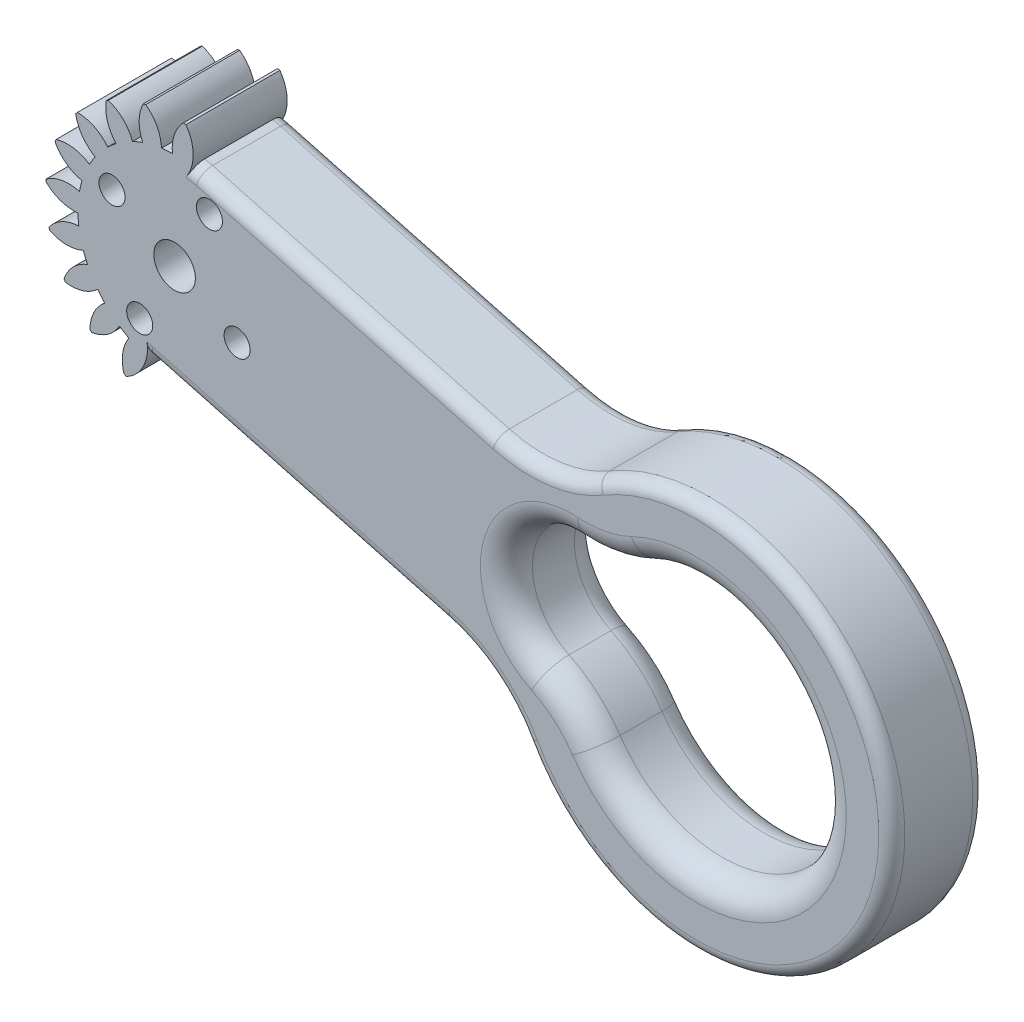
ISO-10303-21;
HEADER;
FILE_DESCRIPTION(('STEP AP214'),'2;1');
FILE_NAME('part.step','',(''),(''),'','','');
FILE_SCHEMA(('AUTOMOTIVE_DESIGN { 1 0 10303 214 1 1 1 1 }'));
ENDSEC;
DATA;
#1=APPLICATION_CONTEXT('core data for automotive mechanical design processes');
#2=APPLICATION_PROTOCOL_DEFINITION('international standard','automotive_design',2000,#1);
#3=PRODUCT_CONTEXT('',#1,'mechanical');
#4=PRODUCT('Part','Part','',(#3));
#5=PRODUCT_RELATED_PRODUCT_CATEGORY('part','',(#4));
#6=PRODUCT_DEFINITION_FORMATION('','',#4);
#7=PRODUCT_DEFINITION_CONTEXT('part definition',#1,'design');
#8=PRODUCT_DEFINITION('design','',#6,#7);
#9=PRODUCT_DEFINITION_SHAPE('','',#8);
#10=(LENGTH_UNIT() NAMED_UNIT(*) SI_UNIT(.MILLI.,.METRE.));
#11=(NAMED_UNIT(*) PLANE_ANGLE_UNIT() SI_UNIT($,.RADIAN.));
#12=(NAMED_UNIT(*) SI_UNIT($,.STERADIAN.) SOLID_ANGLE_UNIT());
#13=UNCERTAINTY_MEASURE_WITH_UNIT(LENGTH_MEASURE(1.E-05),#10,'distance_accuracy_value','');
#14=(GEOMETRIC_REPRESENTATION_CONTEXT(3) GLOBAL_UNCERTAINTY_ASSIGNED_CONTEXT((#13)) GLOBAL_UNIT_ASSIGNED_CONTEXT((#10,
#11,#12)) REPRESENTATION_CONTEXT('',''));
#15=CARTESIAN_POINT('',(0.,0.,0.));
#16=DIRECTION('',(0.,0.,1.));
#17=DIRECTION('',(1.,0.,0.));
#18=AXIS2_PLACEMENT_3D('',#15,#16,#17);
#19=CARTESIAN_POINT('',(0.,0.,7.22));
#20=DIRECTION('',(0.,0.,1.));
#21=DIRECTION('',(1.,0.,0.));
#22=AXIS2_PLACEMENT_3D('',#19,#20,#21);
#23=PLANE('',#22);
#24=CARTESIAN_POINT('',(0.,0.,7.22));
#25=DIRECTION('',(0.,0.,1.));
#26=DIRECTION('',(1.,0.,0.));
#27=AXIS2_PLACEMENT_3D('',#24,#25,#26);
#28=CIRCLE('',#27,6.425);
#29=CARTESIAN_POINT('',(1.66879699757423,6.20449366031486,7.22));
#30=VERTEX_POINT('',#29);
#31=CARTESIAN_POINT('',(0.869789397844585,6.36585354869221,7.22));
#32=VERTEX_POINT('',#31);
#33=EDGE_CURVE('E848',#30,#32,#28,.T.);
#34=ORIENTED_EDGE('',*,*,#33,.T.);
#35=CARTESIAN_POINT('',(-1.57785588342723,8.1173648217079,7.22));
#36=DIRECTION('',(0.,0.,1.));
#37=DIRECTION('',(1.,0.,0.));
#38=AXIS2_PLACEMENT_3D('',#35,#36,#37);
#39=CIRCLE('',#38,3.00977726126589);
#40=CARTESIAN_POINT('',(0.875239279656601,9.86123502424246,7.22));
#41=VERTEX_POINT('',#40);
#42=EDGE_CURVE('E700',#41,#32,#39,.F.);
#43=ORIENTED_EDGE('',*,*,#42,.F.);
#44=CARTESIAN_POINT('',(0.,0.,7.22));
#45=DIRECTION('',(0.,0.,1.));
#46=DIRECTION('',(1.,0.,0.));
#47=AXIS2_PLACEMENT_3D('',#44,#45,#46);
#48=CIRCLE('',#47,9.9);
#49=CARTESIAN_POINT('',(0.67817339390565,9.87674444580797,7.22));
#50=VERTEX_POINT('',#49);
#51=EDGE_CURVE('E702',#41,#50,#48,.T.);
#52=ORIENTED_EDGE('',*,*,#51,.T.);
#53=CARTESIAN_POINT('',(2.82826548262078,7.7705955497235,7.22));
#54=DIRECTION('',(0.,0.,1.));
#55=DIRECTION('',(1.,0.,0.));
#56=AXIS2_PLACEMENT_3D('',#53,#54,#55);
#57=CIRCLE('',#56,3.00977726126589);
#58=CARTESIAN_POINT('',(-0.161401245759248,7.42324555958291,7.22));
#59=VERTEX_POINT('',#58);
#60=EDGE_CURVE('E705',#50,#59,#57,.T.);
#61=ORIENTED_EDGE('',*,*,#60,.T.);
#62=CARTESIAN_POINT('',(0.,0.,7.22));
#63=DIRECTION('',(0.,0.,1.));
#64=DIRECTION('',(1.,0.,0.));
#65=AXIS2_PLACEMENT_3D('',#62,#63,#64);
#66=CIRCLE('',#65,7.425);
#67=CARTESIAN_POINT('',(-1.00183731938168,7.35710180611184,7.22));
#68=VERTEX_POINT('',#67);
#69=EDGE_CURVE('E725',#59,#68,#66,.T.);
#70=ORIENTED_EDGE('',*,*,#69,.T.);
#71=CARTESIAN_POINT('',(-4.00903379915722,7.23248842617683,7.22));
#72=DIRECTION('',(0.,0.,1.));
#73=DIRECTION('',(0.951056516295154,0.309016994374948,0.));
#74=AXIS2_PLACEMENT_3D('',#71,#72,#73);
#75=CIRCLE('',#74,3.00977726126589);
#76=CARTESIAN_POINT('',(-2.21488718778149,9.64905564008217,7.22));
#77=VERTEX_POINT('',#76);
#78=EDGE_CURVE('E674',#77,#68,#75,.F.);
#79=ORIENTED_EDGE('',*,*,#78,.F.);
#80=CARTESIAN_POINT('',(0.,0.,7.22));
#81=DIRECTION('',(0.,0.,1.));
#82=DIRECTION('',(0.951056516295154,0.309016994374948,0.));
#83=AXIS2_PLACEMENT_3D('',#80,#81,#82);
#84=CIRCLE('',#83,9.9);
#85=CARTESIAN_POINT('',(-2.40710065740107,9.60290926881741,7.22));
#86=VERTEX_POINT('',#85);
#87=EDGE_CURVE('E677',#77,#86,#84,.T.);
#88=ORIENTED_EDGE('',*,*,#87,.T.);
#89=CARTESIAN_POINT('',(0.288594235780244,8.26425763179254,7.22));
#90=DIRECTION('',(0.,0.,1.));
#91=DIRECTION('',(0.951056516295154,0.309016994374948,0.));
#92=AXIS2_PLACEMENT_3D('',#89,#90,#91);
#93=CIRCLE('',#92,3.00977726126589);
#94=CARTESIAN_POINT('',(-2.44741073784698,7.01005033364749,7.22));
#95=VERTEX_POINT('',#94);
#96=EDGE_CURVE('E680',#86,#95,#93,.T.);
#97=ORIENTED_EDGE('',*,*,#96,.T.);
#98=CARTESIAN_POINT('',(-3.2262733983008,6.68743485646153,7.22));
#99=VERTEX_POINT('',#98);
#100=EDGE_CURVE('E729',#95,#99,#66,.T.);
#101=ORIENTED_EDGE('',*,*,#100,.T.);
#102=CARTESIAN_POINT('',(-6.04777955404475,5.63964567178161,7.22));
#103=DIRECTION('',(0.,0.,1.));
#104=DIRECTION('',(0.809016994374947,0.587785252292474,0.));
#105=AXIS2_PLACEMENT_3D('',#102,#103,#104);
#106=CIRCLE('',#105,3.00977726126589);
#107=CARTESIAN_POINT('',(-5.08820506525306,8.49235946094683,7.22));
#108=VERTEX_POINT('',#107);
#109=EDGE_CURVE('E647',#108,#99,#106,.F.);
#110=ORIENTED_EDGE('',*,*,#109,.F.);
#111=CARTESIAN_POINT('',(0.,0.,7.22));
#112=DIRECTION('',(0.,0.,1.));
#113=DIRECTION('',(0.809016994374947,0.587785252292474,0.));
#114=AXIS2_PLACEMENT_3D('',#111,#112,#113);
#115=CIRCLE('',#114,9.9);
#116=CARTESIAN_POINT('',(-5.25675092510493,8.38907442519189,7.22));
#117=VERTEX_POINT('',#116);
#118=EDGE_CURVE('E650',#108,#117,#115,.T.);
#119=ORIENTED_EDGE('',*,*,#118,.T.);
#120=CARTESIAN_POINT('',(-2.27932662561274,7.94895659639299,7.22));
#121=DIRECTION('',(0.,0.,1.));
#122=DIRECTION('',(0.809016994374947,0.587785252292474,0.));
#123=AXIS2_PLACEMENT_3D('',#120,#121,#122);
#124=CIRCLE('',#123,3.00977726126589);
#125=CARTESIAN_POINT('',(-4.49385061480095,5.91066253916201,7.22));
#126=VERTEX_POINT('',#125);
#127=EDGE_CURVE('E653',#117,#126,#124,.T.);
#128=ORIENTED_EDGE('',*,*,#127,.T.);
#129=CARTESIAN_POINT('',(-5.13489935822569,5.36315518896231,7.22));
#130=VERTEX_POINT('',#129);
#131=EDGE_CURVE('E1937',#126,#130,#66,.T.);
#132=ORIENTED_EDGE('',*,*,#131,.T.);
#133=CARTESIAN_POINT('',(-7.4945265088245,3.49475510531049,7.22));
#134=DIRECTION('',(0.,0.,1.));
#135=DIRECTION('',(0.587785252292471,0.809016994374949,0.));
#136=AXIS2_PLACEMENT_3D('',#133,#134,#135);
#137=CIRCLE('',#136,3.00977726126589);
#138=CARTESIAN_POINT('',(-7.46345397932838,6.50437196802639,7.22));
#139=VERTEX_POINT('',#138);
#140=EDGE_CURVE('E620',#139,#130,#137,.F.);
#141=ORIENTED_EDGE('',*,*,#140,.F.);
#142=CARTESIAN_POINT('',(0.,0.,7.22));
#143=DIRECTION('',(0.,0.,1.));
#144=DIRECTION('',(0.587785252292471,0.809016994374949,0.));
#145=AXIS2_PLACEMENT_3D('',#142,#143,#144);
#146=CIRCLE('',#145,9.9);
#147=CARTESIAN_POINT('',(-7.59183378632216,6.35405852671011,7.22));
#148=VERTEX_POINT('',#147);
#149=EDGE_CURVE('E623',#139,#148,#146,.T.);
#150=ORIENTED_EDGE('',*,*,#149,.T.);
#151=CARTESIAN_POINT('',(-4.62413111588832,6.85555630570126,7.22));
#152=DIRECTION('',(0.,0.,1.));
#153=DIRECTION('',(0.587785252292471,0.809016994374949,0.));
#154=AXIS2_PLACEMENT_3D('',#151,#152,#153);
#155=CIRCLE('',#154,3.00977726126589);
#156=CARTESIAN_POINT('',(-6.10040108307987,4.23269791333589,7.22));
#157=VERTEX_POINT('',#156);
#158=EDGE_CURVE('E626',#148,#157,#155,.T.);
#159=ORIENTED_EDGE('',*,*,#158,.T.);
#160=CARTESIAN_POINT('',(-6.54088559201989,3.51389252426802,7.22));
#161=VERTEX_POINT('',#160);
#162=EDGE_CURVE('E1939',#157,#161,#66,.T.);
#163=ORIENTED_EDGE('',*,*,#162,.T.);
#164=CARTESIAN_POINT('',(-8.20765699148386,1.00777355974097,7.22));
#165=DIRECTION('',(0.,0.,1.));
#166=DIRECTION('',(0.309016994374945,0.951056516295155,0.));
#167=AXIS2_PLACEMENT_3D('',#164,#165,#166);
#168=CIRCLE('',#167,3.00977726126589);
#169=CARTESIAN_POINT('',(-9.10812801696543,3.87969122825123,7.22));
#170=VERTEX_POINT('',#169);
#171=EDGE_CURVE('E593',#170,#161,#168,.F.);
#172=ORIENTED_EDGE('',*,*,#171,.F.);
#173=CARTESIAN_POINT('',(0.,0.,7.22));
#174=DIRECTION('',(0.,0.,1.));
#175=DIRECTION('',(0.309016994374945,0.951056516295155,0.));
#176=AXIS2_PLACEMENT_3D('',#173,#174,#175);
#177=CIRCLE('',#176,9.9);
#178=CARTESIAN_POINT('',(-9.18377506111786,3.69706310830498,7.22));
#179=VERTEX_POINT('',#178);
#180=EDGE_CURVE('E596',#170,#179,#177,.T.);
#181=ORIENTED_EDGE('',*,*,#180,.T.);
#182=CARTESIAN_POINT('',(-6.51629343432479,5.09108639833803,7.22));
#183=DIRECTION('',(0.,0.,1.));
#184=DIRECTION('',(0.309016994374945,0.951056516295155,0.));
#185=AXIS2_PLACEMENT_3D('',#182,#183,#184);
#186=CIRCLE('',#185,3.00977726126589);
#187=CARTESIAN_POINT('',(-7.10980178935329,2.14040732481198,7.22));
#188=VERTEX_POINT('',#187);
#189=EDGE_CURVE('E599',#179,#188,#186,.T.);
#190=ORIENTED_EDGE('',*,*,#189,.T.);
#191=CARTESIAN_POINT('',(-7.3066043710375,1.32066557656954,7.22));
#192=VERTEX_POINT('',#191);
#193=EDGE_CURVE('E1942',#188,#192,#66,.T.);
#194=ORIENTED_EDGE('',*,*,#193,.T.);
#195=CARTESIAN_POINT('',(-8.11736482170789,-1.57785588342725,7.22));
#196=DIRECTION('',(0.,0.,1.));
#197=DIRECTION('',(0.,1.,0.));
#198=AXIS2_PLACEMENT_3D('',#195,#196,#197);
#199=CIRCLE('',#198,3.00977726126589);
#200=CARTESIAN_POINT('',(-9.86123502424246,0.875239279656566,7.22));
#201=VERTEX_POINT('',#200);
#202=EDGE_CURVE('E566',#201,#192,#199,.F.);
#203=ORIENTED_EDGE('',*,*,#202,.F.);
#204=CARTESIAN_POINT('',(0.,0.,7.22));
#205=DIRECTION('',(0.,0.,1.));
#206=DIRECTION('',(0.,1.,0.));
#207=AXIS2_PLACEMENT_3D('',#204,#205,#206);
#208=CIRCLE('',#207,9.9);
#209=CARTESIAN_POINT('',(-9.87674444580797,0.678173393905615,7.22));
#210=VERTEX_POINT('',#209);
#211=EDGE_CURVE('E569',#201,#210,#208,.T.);
#212=ORIENTED_EDGE('',*,*,#211,.T.);
#213=CARTESIAN_POINT('',(-7.77059554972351,2.82826548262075,7.22));
#214=DIRECTION('',(0.,0.,1.));
#215=DIRECTION('',(0.,1.,0.));
#216=AXIS2_PLACEMENT_3D('',#213,#214,#215);
#217=CIRCLE('',#216,3.00977726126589);
#218=CARTESIAN_POINT('',(-7.42324555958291,-0.161401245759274,7.22));
#219=VERTEX_POINT('',#218);
#220=EDGE_CURVE('E572',#210,#219,#217,.T.);
#221=ORIENTED_EDGE('',*,*,#220,.T.);
#222=CARTESIAN_POINT('',(-7.35710180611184,-1.00183731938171,7.22));
#223=VERTEX_POINT('',#222);
#224=EDGE_CURVE('E1945',#219,#223,#66,.T.);
#225=ORIENTED_EDGE('',*,*,#224,.T.);
#226=CARTESIAN_POINT('',(-7.23248842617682,-4.00903379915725,7.22));
#227=DIRECTION('',(0.,0.,1.));
#228=DIRECTION('',(-0.309016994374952,0.951056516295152,0.));
#229=AXIS2_PLACEMENT_3D('',#226,#227,#228);
#230=CIRCLE('',#229,3.00977726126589);
#231=CARTESIAN_POINT('',(-9.64905564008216,-2.21488718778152,7.22));
#232=VERTEX_POINT('',#231);
#233=EDGE_CURVE('E539',#232,#223,#230,.F.);
#234=ORIENTED_EDGE('',*,*,#233,.F.);
#235=CARTESIAN_POINT('',(0.,0.,7.22));
#236=DIRECTION('',(0.,0.,1.));
#237=DIRECTION('',(-0.309016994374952,0.951056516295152,0.));
#238=AXIS2_PLACEMENT_3D('',#235,#236,#237);
#239=CIRCLE('',#238,9.9);
#240=CARTESIAN_POINT('',(-9.6029092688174,-2.40710065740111,7.22));
#241=VERTEX_POINT('',#240);
#242=EDGE_CURVE('E542',#232,#241,#239,.T.);
#243=ORIENTED_EDGE('',*,*,#242,.T.);
#244=CARTESIAN_POINT('',(-8.26425763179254,0.288594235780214,7.22));
#245=DIRECTION('',(0.,0.,1.));
#246=DIRECTION('',(-0.309016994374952,0.951056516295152,0.));
#247=AXIS2_PLACEMENT_3D('',#244,#245,#246);
#248=CIRCLE('',#247,3.00977726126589);
#249=CARTESIAN_POINT('',(-7.01005033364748,-2.447410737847,7.22));
#250=VERTEX_POINT('',#249);
#251=EDGE_CURVE('E545',#241,#250,#248,.T.);
#252=ORIENTED_EDGE('',*,*,#251,.T.);
#253=CARTESIAN_POINT('',(-6.68743485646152,-3.22627339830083,7.22));
#254=VERTEX_POINT('',#253);
#255=EDGE_CURVE('E1948',#250,#254,#66,.T.);
#256=ORIENTED_EDGE('',*,*,#255,.T.);
#257=CARTESIAN_POINT('',(-5.63964567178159,-6.04777955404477,7.22));
#258=DIRECTION('',(0.,0.,1.));
#259=DIRECTION('',(-0.587785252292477,0.809016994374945,0.));
#260=AXIS2_PLACEMENT_3D('',#257,#258,#259);
#261=CIRCLE('',#260,3.00977726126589);
#262=CARTESIAN_POINT('',(-8.49235946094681,-5.08820506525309,7.22));
#263=VERTEX_POINT('',#262);
#264=EDGE_CURVE('E512',#263,#254,#261,.F.);
#265=ORIENTED_EDGE('',*,*,#264,.F.);
#266=CARTESIAN_POINT('',(0.,0.,7.22));
#267=DIRECTION('',(0.,0.,1.));
#268=DIRECTION('',(-0.587785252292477,0.809016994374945,0.));
#269=AXIS2_PLACEMENT_3D('',#266,#267,#268);
#270=CIRCLE('',#269,9.9);
#271=CARTESIAN_POINT('',(-8.38907442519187,-5.25675092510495,7.22));
#272=VERTEX_POINT('',#271);
#273=EDGE_CURVE('E515',#263,#272,#270,.T.);
#274=ORIENTED_EDGE('',*,*,#273,.T.);
#275=CARTESIAN_POINT('',(-7.94895659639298,-2.27932662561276,7.22));
#276=DIRECTION('',(0.,0.,1.));
#277=DIRECTION('',(-0.587785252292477,0.809016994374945,0.));
#278=AXIS2_PLACEMENT_3D('',#275,#276,#277);
#279=CIRCLE('',#278,3.00977726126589);
#280=CARTESIAN_POINT('',(-5.910662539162,-4.49385061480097,7.22));
#281=VERTEX_POINT('',#280);
#282=EDGE_CURVE('E518',#272,#281,#279,.T.);
#283=ORIENTED_EDGE('',*,*,#282,.T.);
#284=CARTESIAN_POINT('',(-5.3631551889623,-5.13489935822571,7.22));
#285=VERTEX_POINT('',#284);
#286=EDGE_CURVE('E1951',#281,#285,#66,.T.);
#287=ORIENTED_EDGE('',*,*,#286,.T.);
#288=CARTESIAN_POINT('',(-3.49475510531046,-7.49452650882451,7.22));
#289=DIRECTION('',(0.,0.,1.));
#290=DIRECTION('',(-0.809016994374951,0.587785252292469,0.));
#291=AXIS2_PLACEMENT_3D('',#288,#289,#290);
#292=CIRCLE('',#291,3.00977726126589);
#293=CARTESIAN_POINT('',(-6.50437196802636,-7.4634539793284,7.22));
#294=VERTEX_POINT('',#293);
#295=EDGE_CURVE('E486',#294,#285,#292,.F.);
#296=ORIENTED_EDGE('',*,*,#295,.F.);
#297=CARTESIAN_POINT('',(0.,0.,7.22));
#298=DIRECTION('',(0.,0.,1.));
#299=DIRECTION('',(-0.809016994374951,0.587785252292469,0.));
#300=AXIS2_PLACEMENT_3D('',#297,#298,#299);
#301=CIRCLE('',#300,9.9);
#302=CARTESIAN_POINT('',(-6.35405852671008,-7.59183378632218,7.22));
#303=VERTEX_POINT('',#302);
#304=EDGE_CURVE('E489',#294,#303,#301,.T.);
#305=ORIENTED_EDGE('',*,*,#304,.T.);
#306=CARTESIAN_POINT('',(-6.85555630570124,-4.62413111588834,7.22));
#307=DIRECTION('',(0.,0.,1.));
#308=DIRECTION('',(-0.809016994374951,0.587785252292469,0.));
#309=AXIS2_PLACEMENT_3D('',#306,#307,#308);
#310=CIRCLE('',#309,3.00977726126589);
#311=CARTESIAN_POINT('',(-4.23269791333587,-6.10040108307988,7.22));
#312=VERTEX_POINT('',#311);
#313=EDGE_CURVE('E492',#303,#312,#310,.T.);
#314=ORIENTED_EDGE('',*,*,#313,.T.);
#315=CARTESIAN_POINT('',(-3.513892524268,-6.5408855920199,7.22));
#316=VERTEX_POINT('',#315);
#317=EDGE_CURVE('E467',#312,#316,#66,.T.);
#318=ORIENTED_EDGE('',*,*,#317,.T.);
#319=CARTESIAN_POINT('',(-1.00777355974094,-8.20765699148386,7.22));
#320=DIRECTION('',(0.,0.,1.));
#321=DIRECTION('',(-0.951056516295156,0.309016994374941,0.));
#322=AXIS2_PLACEMENT_3D('',#319,#320,#321);
#323=CIRCLE('',#322,3.00977726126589);
#324=CARTESIAN_POINT('',(-3.87969122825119,-9.10812801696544,7.22));
#325=VERTEX_POINT('',#324);
#326=EDGE_CURVE('E447',#325,#316,#323,.F.);
#327=ORIENTED_EDGE('',*,*,#326,.F.);
#328=CARTESIAN_POINT('',(0.,0.,7.22));
#329=DIRECTION('',(0.,0.,1.));
#330=DIRECTION('',(-0.951056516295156,0.309016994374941,0.));
#331=AXIS2_PLACEMENT_3D('',#328,#329,#330);
#332=CIRCLE('',#331,9.9);
#333=CARTESIAN_POINT('',(-3.69706310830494,-9.18377506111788,7.22));
#334=VERTEX_POINT('',#333);
#335=EDGE_CURVE('E456',#325,#334,#332,.T.);
#336=ORIENTED_EDGE('',*,*,#335,.T.);
#337=CARTESIAN_POINT('',(-5.091086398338,-6.51629343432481,7.22));
#338=DIRECTION('',(0.,0.,1.));
#339=DIRECTION('',(-0.951056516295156,0.309016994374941,0.));
#340=AXIS2_PLACEMENT_3D('',#337,#338,#339);
#341=CIRCLE('',#340,3.00977726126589);
#342=CARTESIAN_POINT('',(-2.11504900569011,-6.06689316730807,7.22));
#343=VERTEX_POINT('',#342);
#344=EDGE_CURVE('E461',#334,#343,#341,.T.);
#345=ORIENTED_EDGE('',*,*,#344,.T.);
#346=CARTESIAN_POINT('',(0.,0.,7.22));
#347=DIRECTION('',(0.,0.,1.));
#348=DIRECTION('',(1.,0.,0.));
#349=AXIS2_PLACEMENT_3D('',#346,#347,#348);
#350=CIRCLE('',#349,6.425);
#351=CARTESIAN_POINT('',(-1.66879699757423,-6.20449366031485,7.22));
#352=VERTEX_POINT('',#351);
#353=EDGE_CURVE('E842',#343,#352,#350,.T.);
#354=ORIENTED_EDGE('',*,*,#353,.T.);
#355=DIRECTION('',(0.965679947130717,-0.25973494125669,0.));
#356=VECTOR('',#355,1.);
#357=CARTESIAN_POINT('',(-1.66879699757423,-6.20449366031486,7.22));
#358=LINE('',#357,#356);
#359=CARTESIAN_POINT('',(21.1276391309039,-12.3359567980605,7.22));
#360=VERTEX_POINT('',#359);
#361=EDGE_CURVE('E840',#352,#360,#358,.T.);
#362=ORIENTED_EDGE('',*,*,#361,.T.);
#363=CARTESIAN_POINT('',(18.2705547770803,-22.9584362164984,7.22));
#364=DIRECTION('',(0.,0.,1.));
#365=DIRECTION('',(1.,0.,0.));
#366=AXIS2_PLACEMENT_3D('',#363,#364,#365);
#367=CIRCLE('',#366,11.);
#368=CARTESIAN_POINT('',(27.8790158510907,-17.6033007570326,7.22));
#369=VERTEX_POINT('',#368);
#370=EDGE_CURVE('E838',#360,#369,#367,.F.);
#371=ORIENTED_EDGE('',*,*,#370,.T.);
#372=CARTESIAN_POINT('',(40.1079663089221,-10.7876738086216,7.22));
#373=DIRECTION('',(0.,0.,1.));
#374=DIRECTION('',(1.,0.,0.));
#375=AXIS2_PLACEMENT_3D('',#372,#373,#374);
#376=CIRCLE('',#375,14.);
#377=CARTESIAN_POINT('',(32.9480029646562,1.24290909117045,7.22));
#378=VERTEX_POINT('',#377);
#379=EDGE_CURVE('E822',#369,#378,#376,.T.);
#380=ORIENTED_EDGE('',*,*,#379,.T.);
#381=CARTESIAN_POINT('',(27.322317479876,10.6955099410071,7.22));
#382=DIRECTION('',(0.,0.,1.));
#383=DIRECTION('',(1.,0.,0.));
#384=AXIS2_PLACEMENT_3D('',#381,#382,#383);
#385=CIRCLE('',#384,11.);
#386=CARTESIAN_POINT('',(24.4652331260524,0.0730305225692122,7.22));
#387=VERTEX_POINT('',#386);
#388=EDGE_CURVE('E844',#378,#387,#385,.F.);
#389=ORIENTED_EDGE('',*,*,#388,.T.);
#390=DIRECTION('',(-0.965679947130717,0.25973494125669,0.));
#391=VECTOR('',#390,1.);
#392=CARTESIAN_POINT('',(1.66879699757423,6.20449366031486,7.22));
#393=LINE('',#392,#391);
#394=EDGE_CURVE('E846',#387,#30,#393,.T.);
#395=ORIENTED_EDGE('',*,*,#394,.T.);
#396=EDGE_LOOP('',(#34,#43,#52,#61,#70,#79,#88,#97,#101,#110,#119,#128,#132,#141,#150,#159,#163,
#172,#181,#190,#194,#203,#212,#221,#225,#234,#243,#252,#256,#265,#274,#283,#287,#296,#305,#314,
#318,#327,#336,#345,#354,#362,#371,#380,#389,#395));
#397=FACE_BOUND('',#396,.T.);
#398=CARTESIAN_POINT('',(-4.80437254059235,2.677312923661,7.22));
#399=DIRECTION('',(0.,0.,1.));
#400=DIRECTION('',(1.,0.,0.));
#401=AXIS2_PLACEMENT_3D('',#398,#399,#400);
#402=CIRCLE('',#401,1.);
#403=CARTESIAN_POINT('',(-3.80437254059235,2.677312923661,7.22));
#404=VERTEX_POINT('',#403);
#405=EDGE_CURVE('E736',#404,#404,#402,.T.);
#406=ORIENTED_EDGE('',*,*,#405,.F.);
#407=EDGE_LOOP('',(#406));
#408=FACE_BOUND('',#407,.T.);
#409=CARTESIAN_POINT('',(0.,0.,7.22));
#410=DIRECTION('',(0.,0.,1.));
#411=DIRECTION('',(1.,0.,0.));
#412=AXIS2_PLACEMENT_3D('',#409,#410,#411);
#413=CIRCLE('',#412,1.6);
#414=CARTESIAN_POINT('',(1.6,0.,7.22));
#415=VERTEX_POINT('',#414);
#416=EDGE_CURVE('E1054',#415,#415,#413,.T.);
#417=ORIENTED_EDGE('',*,*,#416,.F.);
#418=EDGE_LOOP('',(#417));
#419=FACE_BOUND('',#418,.T.);
#420=CARTESIAN_POINT('',(2.677312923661,4.80437254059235,7.22));
#421=DIRECTION('',(0.,0.,1.));
#422=DIRECTION('',(1.,0.,0.));
#423=AXIS2_PLACEMENT_3D('',#420,#421,#422);
#424=CIRCLE('',#423,1.);
#425=CARTESIAN_POINT('',(3.677312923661,4.80437254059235,7.22));
#426=VERTEX_POINT('',#425);
#427=EDGE_CURVE('E1057',#426,#426,#424,.T.);
#428=ORIENTED_EDGE('',*,*,#427,.F.);
#429=EDGE_LOOP('',(#428));
#430=FACE_BOUND('',#429,.T.);
#431=CARTESIAN_POINT('',(4.80437254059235,-2.677312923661,7.22));
#432=DIRECTION('',(0.,0.,1.));
#433=DIRECTION('',(1.,0.,0.));
#434=AXIS2_PLACEMENT_3D('',#431,#432,#433);
#435=CIRCLE('',#434,1.);
#436=CARTESIAN_POINT('',(5.80437254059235,-2.677312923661,7.22));
#437=VERTEX_POINT('',#436);
#438=EDGE_CURVE('E1060',#437,#437,#435,.T.);
#439=ORIENTED_EDGE('',*,*,#438,.F.);
#440=EDGE_LOOP('',(#439));
#441=FACE_BOUND('',#440,.T.);
#442=CARTESIAN_POINT('',(-2.677312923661,-4.80437254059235,7.22));
#443=DIRECTION('',(0.,0.,1.));
#444=DIRECTION('',(1.,0.,0.));
#445=AXIS2_PLACEMENT_3D('',#442,#443,#444);
#446=CIRCLE('',#445,0.999999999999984);
#447=CARTESIAN_POINT('',(-1.67731292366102,-4.80437254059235,7.22));
#448=VERTEX_POINT('',#447);
#449=EDGE_CURVE('E786',#448,#448,#446,.T.);
#450=ORIENTED_EDGE('',*,*,#449,.F.);
#451=EDGE_LOOP('',(#450));
#452=FACE_BOUND('',#451,.T.);
#453=CARTESIAN_POINT('',(31.5973461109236,6.75710729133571,7.22));
#454=DIRECTION('',(0.,0.,1.));
#455=DIRECTION('',(1.,0.,0.));
#456=AXIS2_PLACEMENT_3D('',#453,#454,#455);
#457=CIRCLE('',#456,8.);
#458=CARTESIAN_POINT('',(35.0888826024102,-0.440751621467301,7.22));
#459=VERTEX_POINT('',#458);
#460=CARTESIAN_POINT('',(31.0100242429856,-1.22130439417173,7.22));
#461=VERTEX_POINT('',#460);
#462=EDGE_CURVE('E802',#459,#461,#457,.F.);
#463=ORIENTED_EDGE('',*,*,#462,.F.);
#464=CARTESIAN_POINT('',(40.1079663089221,-10.7876738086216,7.22));
#465=DIRECTION('',(0.,0.,1.));
#466=DIRECTION('',(1.,0.,0.));
#467=AXIS2_PLACEMENT_3D('',#464,#465,#466);
#468=CIRCLE('',#467,11.5);
#469=CARTESIAN_POINT('',(30.5756327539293,-17.2207614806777,7.22));
#470=VERTEX_POINT('',#469);
#471=EDGE_CURVE('E745',#459,#470,#468,.F.);
#472=ORIENTED_EDGE('',*,*,#471,.T.);
#473=CARTESIAN_POINT('',(23.9444441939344,-21.6959529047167,7.22));
#474=DIRECTION('',(0.,0.,1.));
#475=DIRECTION('',(1.,0.,0.));
#476=AXIS2_PLACEMENT_3D('',#473,#474,#475);
#477=CIRCLE('',#476,8.);
#478=CARTESIAN_POINT('',(27.4386700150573,-14.4993991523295,7.22));
#479=VERTEX_POINT('',#478);
#480=EDGE_CURVE('E799',#479,#470,#477,.F.);
#481=ORIENTED_EDGE('',*,*,#480,.F.);
#482=CARTESIAN_POINT('',(30.4961176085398,-8.20241461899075,7.22));
#483=DIRECTION('',(0.,0.,1.));
#484=DIRECTION('',(1.,0.,0.));
#485=AXIS2_PLACEMENT_3D('',#482,#483,#484);
#486=CIRCLE('',#485,7.);
#487=EDGE_CURVE('E742',#479,#461,#486,.F.);
#488=ORIENTED_EDGE('',*,*,#487,.T.);
#489=EDGE_LOOP('',(#463,#472,#481,#488));
#490=FACE_BOUND('',#489,.T.);
#491=ADVANCED_FACE('F38',(#397,#408,#419,#430,#441,#452,#490),#23,.T.);
#492=CARTESIAN_POINT('',(0.,0.,0.));
#493=DIRECTION('',(0.,0.,1.));
#494=DIRECTION('',(1.,0.,0.));
#495=AXIS2_PLACEMENT_3D('',#492,#493,#494);
#496=PLANE('',#495);
#497=CARTESIAN_POINT('',(4.80437254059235,-2.677312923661,0.));
#498=DIRECTION('',(0.,0.,-1.));
#499=DIRECTION('',(-1.,0.,0.));
#500=AXIS2_PLACEMENT_3D('',#497,#498,#499);
#501=CIRCLE('',#500,1.5);
#502=CARTESIAN_POINT('',(3.30437254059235,-2.677312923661,0.));
#503=VERTEX_POINT('',#502);
#504=EDGE_CURVE('E830',#503,#503,#501,.T.);
#505=ORIENTED_EDGE('',*,*,#504,.F.);
#506=EDGE_LOOP('',(#505));
#507=FACE_BOUND('',#506,.T.);
#508=CARTESIAN_POINT('',(-4.80437254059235,2.677312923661,0.));
#509=DIRECTION('',(0.,0.,-1.));
#510=DIRECTION('',(-1.,0.,0.));
#511=AXIS2_PLACEMENT_3D('',#508,#509,#510);
#512=CIRCLE('',#511,1.5);
#513=CARTESIAN_POINT('',(-6.30437254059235,2.677312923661,0.));
#514=VERTEX_POINT('',#513);
#515=EDGE_CURVE('E1038',#514,#514,#512,.T.);
#516=ORIENTED_EDGE('',*,*,#515,.F.);
#517=EDGE_LOOP('',(#516));
#518=FACE_BOUND('',#517,.T.);
#519=CARTESIAN_POINT('',(-1.57785588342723,8.1173648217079,0.));
#520=DIRECTION('',(0.,0.,1.));
#521=DIRECTION('',(1.,0.,0.));
#522=AXIS2_PLACEMENT_3D('',#519,#520,#521);
#523=CIRCLE('',#522,3.00977726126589);
#524=CARTESIAN_POINT('',(0.875239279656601,9.86123502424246,0.));
#525=VERTEX_POINT('',#524);
#526=CARTESIAN_POINT('',(0.869789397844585,6.36585354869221,0.));
#527=VERTEX_POINT('',#526);
#528=EDGE_CURVE('E63',#525,#527,#523,.F.);
#529=ORIENTED_EDGE('',*,*,#528,.T.);
#530=CARTESIAN_POINT('',(0.,0.,0.));
#531=DIRECTION('',(0.,0.,1.));
#532=DIRECTION('',(1.,0.,0.));
#533=AXIS2_PLACEMENT_3D('',#530,#531,#532);
#534=CIRCLE('',#533,6.425);
#535=CARTESIAN_POINT('',(1.66879699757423,6.20449366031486,0.));
#536=VERTEX_POINT('',#535);
#537=EDGE_CURVE('E889',#527,#536,#534,.F.);
#538=ORIENTED_EDGE('',*,*,#537,.T.);
#539=DIRECTION('',(0.965679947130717,-0.25973494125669,0.));
#540=VECTOR('',#539,1.);
#541=CARTESIAN_POINT('',(24.4652331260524,0.0730305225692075,0.));
#542=LINE('',#541,#540);
#543=CARTESIAN_POINT('',(1.96546139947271,6.12470106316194,0.));
#544=VERTEX_POINT('',#543);
#545=EDGE_CURVE('E887',#536,#544,#542,.T.);
#546=ORIENTED_EDGE('',*,*,#545,.T.);
#547=CARTESIAN_POINT('',(2.677312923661,4.80437254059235,0.));
#548=DIRECTION('',(0.,0.,-1.));
#549=DIRECTION('',(-1.,0.,0.));
#550=AXIS2_PLACEMENT_3D('',#547,#548,#549);
#551=CIRCLE('',#550,1.5);
#552=CARTESIAN_POINT('',(3.95545002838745,5.5894620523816,0.));
#553=VERTEX_POINT('',#552);
#554=EDGE_CURVE('E1048',#553,#544,#551,.T.);
#555=ORIENTED_EDGE('',*,*,#554,.F.);
#556=DIRECTION('',(0.965679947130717,-0.25973494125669,0.));
#557=VECTOR('',#556,1.);
#558=CARTESIAN_POINT('',(24.4652331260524,0.0730305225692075,0.));
#559=LINE('',#558,#557);
#560=CARTESIAN_POINT('',(24.4652331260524,0.0730305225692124,0.));
#561=VERTEX_POINT('',#560);
#562=EDGE_CURVE('E885',#553,#561,#559,.T.);
#563=ORIENTED_EDGE('',*,*,#562,.T.);
#564=CARTESIAN_POINT('',(27.322317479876,10.6955099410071,0.));
#565=DIRECTION('',(0.,0.,1.));
#566=DIRECTION('',(1.,0.,0.));
#567=AXIS2_PLACEMENT_3D('',#564,#565,#566);
#568=CIRCLE('',#567,11.);
#569=CARTESIAN_POINT('',(32.9480029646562,1.24290909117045,0.));
#570=VERTEX_POINT('',#569);
#571=EDGE_CURVE('E883',#561,#570,#568,.T.);
#572=ORIENTED_EDGE('',*,*,#571,.T.);
#573=CARTESIAN_POINT('',(40.1079663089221,-10.7876738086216,0.));
#574=DIRECTION('',(0.,0.,1.));
#575=DIRECTION('',(1.,0.,0.));
#576=AXIS2_PLACEMENT_3D('',#573,#574,#575);
#577=CIRCLE('',#576,14.);
#578=CARTESIAN_POINT('',(27.8790158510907,-17.6033007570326,0.));
#579=VERTEX_POINT('',#578);
#580=EDGE_CURVE('E875',#570,#579,#577,.F.);
#581=ORIENTED_EDGE('',*,*,#580,.T.);
#582=CARTESIAN_POINT('',(18.2705547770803,-22.9584362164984,0.));
#583=DIRECTION('',(0.,0.,1.));
#584=DIRECTION('',(1.,0.,0.));
#585=AXIS2_PLACEMENT_3D('',#582,#583,#584);
#586=CIRCLE('',#585,11.);
#587=CARTESIAN_POINT('',(21.1276391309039,-12.3359567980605,0.));
#588=VERTEX_POINT('',#587);
#589=EDGE_CURVE('E877',#579,#588,#586,.T.);
#590=ORIENTED_EDGE('',*,*,#589,.T.);
#591=DIRECTION('',(-0.965679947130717,0.25973494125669,0.));
#592=VECTOR('',#591,1.);
#593=CARTESIAN_POINT('',(-1.66879699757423,-6.20449366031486,0.));
#594=LINE('',#593,#592);
#595=CARTESIAN_POINT('',(-1.66879699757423,-6.20449366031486,0.));
#596=VERTEX_POINT('',#595);
#597=EDGE_CURVE('E879',#588,#596,#594,.T.);
#598=ORIENTED_EDGE('',*,*,#597,.T.);
#599=CARTESIAN_POINT('',(0.,0.,0.));
#600=DIRECTION('',(0.,0.,1.));
#601=DIRECTION('',(1.,0.,0.));
#602=AXIS2_PLACEMENT_3D('',#599,#600,#601);
#603=CIRCLE('',#602,6.425);
#604=CARTESIAN_POINT('',(-1.9565387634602,-6.11985139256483,0.));
#605=VERTEX_POINT('',#604);
#606=EDGE_CURVE('E881',#596,#605,#603,.F.);
#607=ORIENTED_EDGE('',*,*,#606,.T.);
#608=CARTESIAN_POINT('',(-2.677312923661,-4.80437254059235,0.));
#609=DIRECTION('',(0.,0.,-1.));
#610=DIRECTION('',(-1.,0.,0.));
#611=AXIS2_PLACEMENT_3D('',#608,#609,#610);
#612=CIRCLE('',#611,1.5);
#613=CARTESIAN_POINT('',(-2.09921264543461,-6.1884968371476,0.));
#614=VERTEX_POINT('',#613);
#615=EDGE_CURVE('E1031',#614,#605,#612,.T.);
#616=ORIENTED_EDGE('',*,*,#615,.F.);
#617=CARTESIAN_POINT('',(-5.091086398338,-6.51629343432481,0.));
#618=DIRECTION('',(0.,0.,1.));
#619=DIRECTION('',(-0.951056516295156,0.309016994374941,0.));
#620=AXIS2_PLACEMENT_3D('',#617,#618,#619);
#621=CIRCLE('',#620,3.00977726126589);
#622=CARTESIAN_POINT('',(-3.69706310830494,-9.18377506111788,0.));
#623=VERTEX_POINT('',#622);
#624=EDGE_CURVE('E468',#623,#614,#621,.T.);
#625=ORIENTED_EDGE('',*,*,#624,.F.);
#626=CARTESIAN_POINT('',(0.,0.,0.));
#627=DIRECTION('',(0.,0.,1.));
#628=DIRECTION('',(-0.951056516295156,0.309016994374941,0.));
#629=AXIS2_PLACEMENT_3D('',#626,#627,#628);
#630=CIRCLE('',#629,9.9);
#631=CARTESIAN_POINT('',(-3.87969122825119,-9.10812801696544,0.));
#632=VERTEX_POINT('',#631);
#633=EDGE_CURVE('E470',#632,#623,#630,.T.);
#634=ORIENTED_EDGE('',*,*,#633,.F.);
#635=CARTESIAN_POINT('',(-1.00777355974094,-8.20765699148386,0.));
#636=DIRECTION('',(0.,0.,1.));
#637=DIRECTION('',(-0.951056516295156,0.309016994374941,0.));
#638=AXIS2_PLACEMENT_3D('',#635,#636,#637);
#639=CIRCLE('',#638,3.00977726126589);
#640=CARTESIAN_POINT('',(-3.513892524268,-6.5408855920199,0.));
#641=VERTEX_POINT('',#640);
#642=EDGE_CURVE('E449',#632,#641,#639,.F.);
#643=ORIENTED_EDGE('',*,*,#642,.T.);
#644=CARTESIAN_POINT('',(0.,0.,0.));
#645=DIRECTION('',(0.,0.,1.));
#646=DIRECTION('',(1.,0.,0.));
#647=AXIS2_PLACEMENT_3D('',#644,#645,#646);
#648=CIRCLE('',#647,7.425);
#649=CARTESIAN_POINT('',(-4.23269791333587,-6.10040108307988,0.));
#650=VERTEX_POINT('',#649);
#651=EDGE_CURVE('E724',#650,#641,#648,.T.);
#652=ORIENTED_EDGE('',*,*,#651,.F.);
#653=CARTESIAN_POINT('',(-6.85555630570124,-4.62413111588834,0.));
#654=DIRECTION('',(0.,0.,1.));
#655=DIRECTION('',(-0.809016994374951,0.587785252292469,0.));
#656=AXIS2_PLACEMENT_3D('',#653,#654,#655);
#657=CIRCLE('',#656,3.00977726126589);
#658=CARTESIAN_POINT('',(-6.35405852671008,-7.59183378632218,0.));
#659=VERTEX_POINT('',#658);
#660=EDGE_CURVE('E490',#659,#650,#657,.T.);
#661=ORIENTED_EDGE('',*,*,#660,.F.);
#662=CARTESIAN_POINT('',(0.,0.,0.));
#663=DIRECTION('',(0.,0.,1.));
#664=DIRECTION('',(-0.809016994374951,0.587785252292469,0.));
#665=AXIS2_PLACEMENT_3D('',#662,#663,#664);
#666=CIRCLE('',#665,9.9);
#667=CARTESIAN_POINT('',(-6.50437196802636,-7.4634539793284,0.));
#668=VERTEX_POINT('',#667);
#669=EDGE_CURVE('E497',#668,#659,#666,.T.);
#670=ORIENTED_EDGE('',*,*,#669,.F.);
#671=CARTESIAN_POINT('',(-3.49475510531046,-7.49452650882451,0.));
#672=DIRECTION('',(0.,0.,1.));
#673=DIRECTION('',(-0.809016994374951,0.587785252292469,0.));
#674=AXIS2_PLACEMENT_3D('',#671,#672,#673);
#675=CIRCLE('',#674,3.00977726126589);
#676=CARTESIAN_POINT('',(-5.3631551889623,-5.13489935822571,0.));
#677=VERTEX_POINT('',#676);
#678=EDGE_CURVE('E452',#668,#677,#675,.F.);
#679=ORIENTED_EDGE('',*,*,#678,.T.);
#680=CARTESIAN_POINT('',(-5.910662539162,-4.49385061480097,0.));
#681=VERTEX_POINT('',#680);
#682=EDGE_CURVE('E1964',#681,#677,#648,.T.);
#683=ORIENTED_EDGE('',*,*,#682,.F.);
#684=CARTESIAN_POINT('',(-7.94895659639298,-2.27932662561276,0.));
#685=DIRECTION('',(0.,0.,1.));
#686=DIRECTION('',(-0.587785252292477,0.809016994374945,0.));
#687=AXIS2_PLACEMENT_3D('',#684,#685,#686);
#688=CIRCLE('',#687,3.00977726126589);
#689=CARTESIAN_POINT('',(-8.38907442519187,-5.25675092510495,0.));
#690=VERTEX_POINT('',#689);
#691=EDGE_CURVE('E516',#690,#681,#688,.T.);
#692=ORIENTED_EDGE('',*,*,#691,.F.);
#693=CARTESIAN_POINT('',(0.,0.,0.));
#694=DIRECTION('',(0.,0.,1.));
#695=DIRECTION('',(-0.587785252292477,0.809016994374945,0.));
#696=AXIS2_PLACEMENT_3D('',#693,#694,#695);
#697=CIRCLE('',#696,9.9);
#698=CARTESIAN_POINT('',(-8.49235946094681,-5.08820506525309,0.));
#699=VERTEX_POINT('',#698);
#700=EDGE_CURVE('E524',#699,#690,#697,.T.);
#701=ORIENTED_EDGE('',*,*,#700,.F.);
#702=CARTESIAN_POINT('',(-5.63964567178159,-6.04777955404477,0.));
#703=DIRECTION('',(0.,0.,1.));
#704=DIRECTION('',(-0.587785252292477,0.809016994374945,0.));
#705=AXIS2_PLACEMENT_3D('',#702,#703,#704);
#706=CIRCLE('',#705,3.00977726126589);
#707=CARTESIAN_POINT('',(-6.68743485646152,-3.22627339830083,0.));
#708=VERTEX_POINT('',#707);
#709=EDGE_CURVE('E511',#699,#708,#706,.F.);
#710=ORIENTED_EDGE('',*,*,#709,.T.);
#711=CARTESIAN_POINT('',(-7.01005033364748,-2.447410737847,0.));
#712=VERTEX_POINT('',#711);
#713=EDGE_CURVE('E1965',#712,#708,#648,.T.);
#714=ORIENTED_EDGE('',*,*,#713,.F.);
#715=CARTESIAN_POINT('',(-8.26425763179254,0.288594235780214,0.));
#716=DIRECTION('',(0.,0.,1.));
#717=DIRECTION('',(-0.309016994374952,0.951056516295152,0.));
#718=AXIS2_PLACEMENT_3D('',#715,#716,#717);
#719=CIRCLE('',#718,3.00977726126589);
#720=CARTESIAN_POINT('',(-9.6029092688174,-2.40710065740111,0.));
#721=VERTEX_POINT('',#720);
#722=EDGE_CURVE('E543',#721,#712,#719,.T.);
#723=ORIENTED_EDGE('',*,*,#722,.F.);
#724=CARTESIAN_POINT('',(0.,0.,0.));
#725=DIRECTION('',(0.,0.,1.));
#726=DIRECTION('',(-0.309016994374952,0.951056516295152,0.));
#727=AXIS2_PLACEMENT_3D('',#724,#725,#726);
#728=CIRCLE('',#727,9.9);
#729=CARTESIAN_POINT('',(-9.64905564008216,-2.21488718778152,0.));
#730=VERTEX_POINT('',#729);
#731=EDGE_CURVE('E551',#730,#721,#728,.T.);
#732=ORIENTED_EDGE('',*,*,#731,.F.);
#733=CARTESIAN_POINT('',(-7.23248842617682,-4.00903379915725,0.));
#734=DIRECTION('',(0.,0.,1.));
#735=DIRECTION('',(-0.309016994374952,0.951056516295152,0.));
#736=AXIS2_PLACEMENT_3D('',#733,#734,#735);
#737=CIRCLE('',#736,3.00977726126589);
#738=CARTESIAN_POINT('',(-7.35710180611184,-1.00183731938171,0.));
#739=VERTEX_POINT('',#738);
#740=EDGE_CURVE('E538',#730,#739,#737,.F.);
#741=ORIENTED_EDGE('',*,*,#740,.T.);
#742=CARTESIAN_POINT('',(-7.42324555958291,-0.161401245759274,0.));
#743=VERTEX_POINT('',#742);
#744=EDGE_CURVE('E1966',#743,#739,#648,.T.);
#745=ORIENTED_EDGE('',*,*,#744,.F.);
#746=CARTESIAN_POINT('',(-7.77059554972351,2.82826548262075,0.));
#747=DIRECTION('',(0.,0.,1.));
#748=DIRECTION('',(0.,1.,0.));
#749=AXIS2_PLACEMENT_3D('',#746,#747,#748);
#750=CIRCLE('',#749,3.00977726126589);
#751=CARTESIAN_POINT('',(-9.87674444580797,0.678173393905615,0.));
#752=VERTEX_POINT('',#751);
#753=EDGE_CURVE('E570',#752,#743,#750,.T.);
#754=ORIENTED_EDGE('',*,*,#753,.F.);
#755=CARTESIAN_POINT('',(0.,0.,0.));
#756=DIRECTION('',(0.,0.,1.));
#757=DIRECTION('',(0.,1.,0.));
#758=AXIS2_PLACEMENT_3D('',#755,#756,#757);
#759=CIRCLE('',#758,9.9);
#760=CARTESIAN_POINT('',(-9.86123502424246,0.875239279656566,0.));
#761=VERTEX_POINT('',#760);
#762=EDGE_CURVE('E578',#761,#752,#759,.T.);
#763=ORIENTED_EDGE('',*,*,#762,.F.);
#764=CARTESIAN_POINT('',(-8.11736482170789,-1.57785588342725,0.));
#765=DIRECTION('',(0.,0.,1.));
#766=DIRECTION('',(0.,1.,0.));
#767=AXIS2_PLACEMENT_3D('',#764,#765,#766);
#768=CIRCLE('',#767,3.00977726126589);
#769=CARTESIAN_POINT('',(-7.3066043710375,1.32066557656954,0.));
#770=VERTEX_POINT('',#769);
#771=EDGE_CURVE('E565',#761,#770,#768,.F.);
#772=ORIENTED_EDGE('',*,*,#771,.T.);
#773=CARTESIAN_POINT('',(-7.10980178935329,2.14040732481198,0.));
#774=VERTEX_POINT('',#773);
#775=EDGE_CURVE('E1967',#774,#770,#648,.T.);
#776=ORIENTED_EDGE('',*,*,#775,.F.);
#777=CARTESIAN_POINT('',(-6.51629343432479,5.09108639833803,0.));
#778=DIRECTION('',(0.,0.,1.));
#779=DIRECTION('',(0.309016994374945,0.951056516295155,0.));
#780=AXIS2_PLACEMENT_3D('',#777,#778,#779);
#781=CIRCLE('',#780,3.00977726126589);
#782=CARTESIAN_POINT('',(-9.18377506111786,3.69706310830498,0.));
#783=VERTEX_POINT('',#782);
#784=EDGE_CURVE('E597',#783,#774,#781,.T.);
#785=ORIENTED_EDGE('',*,*,#784,.F.);
#786=CARTESIAN_POINT('',(0.,0.,0.));
#787=DIRECTION('',(0.,0.,1.));
#788=DIRECTION('',(0.309016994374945,0.951056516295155,0.));
#789=AXIS2_PLACEMENT_3D('',#786,#787,#788);
#790=CIRCLE('',#789,9.9);
#791=CARTESIAN_POINT('',(-9.10812801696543,3.87969122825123,0.));
#792=VERTEX_POINT('',#791);
#793=EDGE_CURVE('E605',#792,#783,#790,.T.);
#794=ORIENTED_EDGE('',*,*,#793,.F.);
#795=CARTESIAN_POINT('',(-8.20765699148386,1.00777355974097,0.));
#796=DIRECTION('',(0.,0.,1.));
#797=DIRECTION('',(0.309016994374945,0.951056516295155,0.));
#798=AXIS2_PLACEMENT_3D('',#795,#796,#797);
#799=CIRCLE('',#798,3.00977726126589);
#800=CARTESIAN_POINT('',(-6.54088559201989,3.51389252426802,0.));
#801=VERTEX_POINT('',#800);
#802=EDGE_CURVE('E592',#792,#801,#799,.F.);
#803=ORIENTED_EDGE('',*,*,#802,.T.);
#804=CARTESIAN_POINT('',(-6.10040108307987,4.23269791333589,0.));
#805=VERTEX_POINT('',#804);
#806=EDGE_CURVE('E1968',#805,#801,#648,.T.);
#807=ORIENTED_EDGE('',*,*,#806,.F.);
#808=CARTESIAN_POINT('',(-4.62413111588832,6.85555630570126,0.));
#809=DIRECTION('',(0.,0.,1.));
#810=DIRECTION('',(0.587785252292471,0.809016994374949,0.));
#811=AXIS2_PLACEMENT_3D('',#808,#809,#810);
#812=CIRCLE('',#811,3.00977726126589);
#813=CARTESIAN_POINT('',(-7.59183378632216,6.35405852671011,0.));
#814=VERTEX_POINT('',#813);
#815=EDGE_CURVE('E624',#814,#805,#812,.T.);
#816=ORIENTED_EDGE('',*,*,#815,.F.);
#817=CARTESIAN_POINT('',(0.,0.,0.));
#818=DIRECTION('',(0.,0.,1.));
#819=DIRECTION('',(0.587785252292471,0.809016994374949,0.));
#820=AXIS2_PLACEMENT_3D('',#817,#818,#819);
#821=CIRCLE('',#820,9.9);
#822=CARTESIAN_POINT('',(-7.46345397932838,6.50437196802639,0.));
#823=VERTEX_POINT('',#822);
#824=EDGE_CURVE('E632',#823,#814,#821,.T.);
#825=ORIENTED_EDGE('',*,*,#824,.F.);
#826=CARTESIAN_POINT('',(-7.4945265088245,3.49475510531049,0.));
#827=DIRECTION('',(0.,0.,1.));
#828=DIRECTION('',(0.587785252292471,0.809016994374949,0.));
#829=AXIS2_PLACEMENT_3D('',#826,#827,#828);
#830=CIRCLE('',#829,3.00977726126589);
#831=CARTESIAN_POINT('',(-5.13489935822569,5.36315518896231,0.));
#832=VERTEX_POINT('',#831);
#833=EDGE_CURVE('E619',#823,#832,#830,.F.);
#834=ORIENTED_EDGE('',*,*,#833,.T.);
#835=CARTESIAN_POINT('',(-4.49385061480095,5.91066253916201,0.));
#836=VERTEX_POINT('',#835);
#837=EDGE_CURVE('E1969',#836,#832,#648,.T.);
#838=ORIENTED_EDGE('',*,*,#837,.F.);
#839=CARTESIAN_POINT('',(-2.27932662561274,7.94895659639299,0.));
#840=DIRECTION('',(0.,0.,1.));
#841=DIRECTION('',(0.809016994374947,0.587785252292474,0.));
#842=AXIS2_PLACEMENT_3D('',#839,#840,#841);
#843=CIRCLE('',#842,3.00977726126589);
#844=CARTESIAN_POINT('',(-5.25675092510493,8.38907442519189,0.));
#845=VERTEX_POINT('',#844);
#846=EDGE_CURVE('E651',#845,#836,#843,.T.);
#847=ORIENTED_EDGE('',*,*,#846,.F.);
#848=CARTESIAN_POINT('',(0.,0.,0.));
#849=DIRECTION('',(0.,0.,1.));
#850=DIRECTION('',(0.809016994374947,0.587785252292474,0.));
#851=AXIS2_PLACEMENT_3D('',#848,#849,#850);
#852=CIRCLE('',#851,9.9);
#853=CARTESIAN_POINT('',(-5.08820506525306,8.49235946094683,0.));
#854=VERTEX_POINT('',#853);
#855=EDGE_CURVE('E659',#854,#845,#852,.T.);
#856=ORIENTED_EDGE('',*,*,#855,.F.);
#857=CARTESIAN_POINT('',(-6.04777955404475,5.63964567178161,0.));
#858=DIRECTION('',(0.,0.,1.));
#859=DIRECTION('',(0.809016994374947,0.587785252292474,0.));
#860=AXIS2_PLACEMENT_3D('',#857,#858,#859);
#861=CIRCLE('',#860,3.00977726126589);
#862=CARTESIAN_POINT('',(-3.2262733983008,6.68743485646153,0.));
#863=VERTEX_POINT('',#862);
#864=EDGE_CURVE('E646',#854,#863,#861,.F.);
#865=ORIENTED_EDGE('',*,*,#864,.T.);
#866=CARTESIAN_POINT('',(-2.44741073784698,7.01005033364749,0.));
#867=VERTEX_POINT('',#866);
#868=EDGE_CURVE('E732',#867,#863,#648,.T.);
#869=ORIENTED_EDGE('',*,*,#868,.F.);
#870=CARTESIAN_POINT('',(0.288594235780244,8.26425763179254,0.));
#871=DIRECTION('',(0.,0.,1.));
#872=DIRECTION('',(0.951056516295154,0.309016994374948,0.));
#873=AXIS2_PLACEMENT_3D('',#870,#871,#872);
#874=CIRCLE('',#873,3.00977726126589);
#875=CARTESIAN_POINT('',(-2.40710065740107,9.60290926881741,0.));
#876=VERTEX_POINT('',#875);
#877=EDGE_CURVE('E678',#876,#867,#874,.T.);
#878=ORIENTED_EDGE('',*,*,#877,.F.);
#879=CARTESIAN_POINT('',(0.,0.,0.));
#880=DIRECTION('',(0.,0.,1.));
#881=DIRECTION('',(0.951056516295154,0.309016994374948,0.));
#882=AXIS2_PLACEMENT_3D('',#879,#880,#881);
#883=CIRCLE('',#882,9.9);
#884=CARTESIAN_POINT('',(-2.21488718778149,9.64905564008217,0.));
#885=VERTEX_POINT('',#884);
#886=EDGE_CURVE('E686',#885,#876,#883,.T.);
#887=ORIENTED_EDGE('',*,*,#886,.F.);
#888=CARTESIAN_POINT('',(-4.00903379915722,7.23248842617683,0.));
#889=DIRECTION('',(0.,0.,1.));
#890=DIRECTION('',(0.951056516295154,0.309016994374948,0.));
#891=AXIS2_PLACEMENT_3D('',#888,#889,#890);
#892=CIRCLE('',#891,3.00977726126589);
#893=CARTESIAN_POINT('',(-1.00183731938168,7.35710180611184,0.));
#894=VERTEX_POINT('',#893);
#895=EDGE_CURVE('E673',#885,#894,#892,.F.);
#896=ORIENTED_EDGE('',*,*,#895,.T.);
#897=CARTESIAN_POINT('',(-0.161401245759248,7.42324555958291,0.));
#898=VERTEX_POINT('',#897);
#899=EDGE_CURVE('E730',#898,#894,#648,.T.);
#900=ORIENTED_EDGE('',*,*,#899,.F.);
#901=CARTESIAN_POINT('',(2.82826548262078,7.7705955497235,0.));
#902=DIRECTION('',(0.,0.,1.));
#903=DIRECTION('',(1.,0.,0.));
#904=AXIS2_PLACEMENT_3D('',#901,#902,#903);
#905=CIRCLE('',#904,3.00977726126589);
#906=CARTESIAN_POINT('',(0.67817339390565,9.87674444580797,0.));
#907=VERTEX_POINT('',#906);
#908=EDGE_CURVE('E703',#907,#898,#905,.T.);
#909=ORIENTED_EDGE('',*,*,#908,.F.);
#910=CARTESIAN_POINT('',(0.,0.,0.));
#911=DIRECTION('',(0.,0.,1.));
#912=DIRECTION('',(1.,0.,0.));
#913=AXIS2_PLACEMENT_3D('',#910,#911,#912);
#914=CIRCLE('',#913,9.9);
#915=EDGE_CURVE('E710',#525,#907,#914,.T.);
#916=ORIENTED_EDGE('',*,*,#915,.F.);
#917=EDGE_LOOP('',(#529,#538,#546,#555,#563,#572,#581,#590,#598,#607,#616,#625,#634,#643,#652,
#661,#670,#679,#683,#692,#701,#710,#714,#723,#732,#741,#745,#754,#763,#772,#776,#785,#794,#803,
#807,#816,#825,#834,#838,#847,#856,#865,#869,#878,#887,#896,#900,#909,#916));
#918=FACE_BOUND('',#917,.T.);
#919=CARTESIAN_POINT('',(0.,0.,0.));
#920=DIRECTION('',(0.,0.,1.));
#921=DIRECTION('',(1.,0.,0.));
#922=AXIS2_PLACEMENT_3D('',#919,#920,#921);
#923=CIRCLE('',#922,1.6);
#924=CARTESIAN_POINT('',(1.6,0.,0.));
#925=VERTEX_POINT('',#924);
#926=EDGE_CURVE('E733',#925,#925,#923,.T.);
#927=ORIENTED_EDGE('',*,*,#926,.T.);
#928=EDGE_LOOP('',(#927));
#929=FACE_BOUND('',#928,.T.);
#930=CARTESIAN_POINT('',(31.5973461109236,6.75710729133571,0.));
#931=DIRECTION('',(0.,0.,1.));
#932=DIRECTION('',(1.,0.,0.));
#933=AXIS2_PLACEMENT_3D('',#930,#931,#932);
#934=CIRCLE('',#933,8.);
#935=CARTESIAN_POINT('',(31.0100242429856,-1.22130439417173,0.));
#936=VERTEX_POINT('',#935);
#937=CARTESIAN_POINT('',(35.0888826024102,-0.440751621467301,0.));
#938=VERTEX_POINT('',#937);
#939=EDGE_CURVE('E788',#936,#938,#934,.T.);
#940=ORIENTED_EDGE('',*,*,#939,.F.);
#941=CARTESIAN_POINT('',(30.4961176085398,-8.20241461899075,0.));
#942=DIRECTION('',(0.,0.,1.));
#943=DIRECTION('',(1.,0.,0.));
#944=AXIS2_PLACEMENT_3D('',#941,#942,#943);
#945=CIRCLE('',#944,7.);
#946=CARTESIAN_POINT('',(27.4386700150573,-14.4993991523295,0.));
#947=VERTEX_POINT('',#946);
#948=EDGE_CURVE('E754',#936,#947,#945,.T.);
#949=ORIENTED_EDGE('',*,*,#948,.T.);
#950=CARTESIAN_POINT('',(23.9444441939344,-21.6959529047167,0.));
#951=DIRECTION('',(0.,0.,1.));
#952=DIRECTION('',(1.,0.,0.));
#953=AXIS2_PLACEMENT_3D('',#950,#951,#952);
#954=CIRCLE('',#953,8.);
#955=CARTESIAN_POINT('',(30.5756327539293,-17.2207614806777,0.));
#956=VERTEX_POINT('',#955);
#957=EDGE_CURVE('E772',#956,#947,#954,.T.);
#958=ORIENTED_EDGE('',*,*,#957,.F.);
#959=CARTESIAN_POINT('',(40.1079663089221,-10.7876738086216,0.));
#960=DIRECTION('',(0.,0.,1.));
#961=DIRECTION('',(1.,0.,0.));
#962=AXIS2_PLACEMENT_3D('',#959,#960,#961);
#963=CIRCLE('',#962,11.5);
#964=EDGE_CURVE('E757',#956,#938,#963,.T.);
#965=ORIENTED_EDGE('',*,*,#964,.T.);
#966=EDGE_LOOP('',(#940,#949,#958,#965));
#967=FACE_BOUND('',#966,.T.);
#968=ADVANCED_FACE('F947',(#507,#518,#918,#929,#967),#496,.F.);
#969=CARTESIAN_POINT('',(-2.677312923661,-4.80437254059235,-2.78));
#970=DIRECTION('',(0.,0.,1.));
#971=DIRECTION('',(1.,0.,0.));
#972=AXIS2_PLACEMENT_3D('',#969,#970,#971);
#973=CYLINDRICAL_SURFACE('',#972,0.999999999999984);
#974=ORIENTED_EDGE('',*,*,#449,.T.);
#975=EDGE_LOOP('',(#974));
#976=FACE_BOUND('',#975,.T.);
#977=CARTESIAN_POINT('',(-2.677312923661,-4.80437254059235,5.2));
#978=DIRECTION('',(0.,0.,-1.));
#979=DIRECTION('',(-1.,0.,0.));
#980=AXIS2_PLACEMENT_3D('',#977,#978,#979);
#981=CIRCLE('',#980,0.999999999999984);
#982=CARTESIAN_POINT('',(-3.67731292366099,-4.80437254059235,5.2));
#983=VERTEX_POINT('',#982);
#984=EDGE_CURVE('E783',#983,#983,#981,.F.);
#985=ORIENTED_EDGE('',*,*,#984,.F.);
#986=EDGE_LOOP('',(#985));
#987=FACE_BOUND('',#986,.T.);
#988=ADVANCED_FACE('F943',(#976,#987),#973,.F.);
#989=CARTESIAN_POINT('',(4.80437254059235,-2.677312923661,-2.78));
#990=DIRECTION('',(0.,0.,1.));
#991=DIRECTION('',(1.,0.,0.));
#992=AXIS2_PLACEMENT_3D('',#989,#990,#991);
#993=CYLINDRICAL_SURFACE('',#992,1.);
#994=ORIENTED_EDGE('',*,*,#438,.T.);
#995=EDGE_LOOP('',(#994));
#996=FACE_BOUND('',#995,.T.);
#997=CARTESIAN_POINT('',(4.80437254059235,-2.677312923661,5.2));
#998=DIRECTION('',(0.,0.,-1.));
#999=DIRECTION('',(-1.,0.,0.));
#1000=AXIS2_PLACEMENT_3D('',#997,#998,#999);
#1001=CIRCLE('',#1000,1.);
#1002=CARTESIAN_POINT('',(3.80437254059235,-2.677312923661,5.2));
#1003=VERTEX_POINT('',#1002);
#1004=EDGE_CURVE('E780',#1003,#1003,#1001,.F.);
#1005=ORIENTED_EDGE('',*,*,#1004,.F.);
#1006=EDGE_LOOP('',(#1005));
#1007=FACE_BOUND('',#1006,.T.);
#1008=ADVANCED_FACE('F939',(#996,#1007),#993,.F.);
#1009=CARTESIAN_POINT('',(2.677312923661,4.80437254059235,-2.78));
#1010=DIRECTION('',(0.,0.,1.));
#1011=DIRECTION('',(1.,0.,0.));
#1012=AXIS2_PLACEMENT_3D('',#1009,#1010,#1011);
#1013=CYLINDRICAL_SURFACE('',#1012,1.);
#1014=ORIENTED_EDGE('',*,*,#427,.T.);
#1015=EDGE_LOOP('',(#1014));
#1016=FACE_BOUND('',#1015,.T.);
#1017=CARTESIAN_POINT('',(2.677312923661,4.80437254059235,5.2));
#1018=DIRECTION('',(0.,0.,-1.));
#1019=DIRECTION('',(-1.,0.,0.));
#1020=AXIS2_PLACEMENT_3D('',#1017,#1018,#1019);
#1021=CIRCLE('',#1020,1.);
#1022=CARTESIAN_POINT('',(1.677312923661,4.80437254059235,5.2));
#1023=VERTEX_POINT('',#1022);
#1024=EDGE_CURVE('E776',#1023,#1023,#1021,.F.);
#1025=ORIENTED_EDGE('',*,*,#1024,.F.);
#1026=EDGE_LOOP('',(#1025));
#1027=FACE_BOUND('',#1026,.T.);
#1028=ADVANCED_FACE('F931',(#1016,#1027),#1013,.F.);
#1029=CARTESIAN_POINT('',(-4.80437254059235,2.677312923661,-2.78));
#1030=DIRECTION('',(0.,0.,1.));
#1031=DIRECTION('',(1.,0.,0.));
#1032=AXIS2_PLACEMENT_3D('',#1029,#1030,#1031);
#1033=CYLINDRICAL_SURFACE('',#1032,1.);
#1034=ORIENTED_EDGE('',*,*,#405,.T.);
#1035=EDGE_LOOP('',(#1034));
#1036=FACE_BOUND('',#1035,.T.);
#1037=CARTESIAN_POINT('',(-4.80437254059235,2.677312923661,5.2));
#1038=DIRECTION('',(0.,0.,-1.));
#1039=DIRECTION('',(-1.,0.,0.));
#1040=AXIS2_PLACEMENT_3D('',#1037,#1038,#1039);
#1041=CIRCLE('',#1040,1.);
#1042=CARTESIAN_POINT('',(-5.80437254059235,2.677312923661,5.2));
#1043=VERTEX_POINT('',#1042);
#1044=EDGE_CURVE('E773',#1043,#1043,#1041,.F.);
#1045=ORIENTED_EDGE('',*,*,#1044,.F.);
#1046=EDGE_LOOP('',(#1045));
#1047=FACE_BOUND('',#1046,.T.);
#1048=ADVANCED_FACE('F927',(#1036,#1047),#1033,.F.);
#1049=CARTESIAN_POINT('',(0.,0.,7.22));
#1050=DIRECTION('',(0.,0.,-1.));
#1051=DIRECTION('',(-1.,0.,0.));
#1052=AXIS2_PLACEMENT_3D('',#1049,#1050,#1051);
#1053=CYLINDRICAL_SURFACE('',#1052,7.425);
#1054=DIRECTION('',(0.,0.,1.));
#1055=VECTOR('',#1054,1.);
#1056=CARTESIAN_POINT('',(-1.92853193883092,-7.17017360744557,-39.5914789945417));
#1057=LINE('',#1056,#1055);
#1058=CARTESIAN_POINT('',(-1.92853193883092,-7.17017360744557,1.));
#1059=VERTEX_POINT('',#1058);
#1060=CARTESIAN_POINT('',(-1.92853193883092,-7.17017360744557,6.22));
#1061=VERTEX_POINT('',#1060);
#1062=EDGE_CURVE('E473',#1059,#1061,#1057,.T.);
#1063=ORIENTED_EDGE('',*,*,#1062,.T.);
#1064=CARTESIAN_POINT('',(0.,0.,6.22));
#1065=DIRECTION('',(0.,0.,1.));
#1066=DIRECTION('',(1.,0.,0.));
#1067=AXIS2_PLACEMENT_3D('',#1064,#1065,#1066);
#1068=CIRCLE('',#1067,7.425);
#1069=CARTESIAN_POINT('',(-2.14040732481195,-7.1098017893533,6.22));
#1070=VERTEX_POINT('',#1069);
#1071=EDGE_CURVE('E865',#1061,#1070,#1068,.F.);
#1072=ORIENTED_EDGE('',*,*,#1071,.T.);
#1073=DIRECTION('',(0.,0.,-1.));
#1074=VECTOR('',#1073,1.);
#1075=CARTESIAN_POINT('',(-2.14040732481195,-7.1098017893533,7.22));
#1076=LINE('',#1075,#1074);
#1077=CARTESIAN_POINT('',(-2.14040732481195,-7.1098017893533,1.));
#1078=VERTEX_POINT('',#1077);
#1079=EDGE_CURVE('E482',#1070,#1078,#1076,.T.);
#1080=ORIENTED_EDGE('',*,*,#1079,.T.);
#1081=CARTESIAN_POINT('',(0.,0.,1.));
#1082=DIRECTION('',(0.,0.,1.));
#1083=DIRECTION('',(1.,0.,0.));
#1084=AXIS2_PLACEMENT_3D('',#1081,#1082,#1083);
#1085=CIRCLE('',#1084,7.425);
#1086=EDGE_CURVE('E863',#1078,#1059,#1085,.T.);
#1087=ORIENTED_EDGE('',*,*,#1086,.T.);
#1088=EDGE_LOOP('',(#1063,#1072,#1080,#1087));
#1089=FACE_BOUND('',#1088,.T.);
#1090=ADVANCED_FACE('F930',(#1089),#1053,.T.);
#1091=DIRECTION('',(0.,0.,-1.));
#1092=VECTOR('',#1091,1.);
#1093=CARTESIAN_POINT('',(1.32066557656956,7.30660437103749,7.22));
#1094=LINE('',#1093,#1092);
#1095=CARTESIAN_POINT('',(1.32066557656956,7.30660437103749,6.22));
#1096=VERTEX_POINT('',#1095);
#1097=CARTESIAN_POINT('',(1.32066557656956,7.30660437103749,1.));
#1098=VERTEX_POINT('',#1097);
#1099=EDGE_CURVE('E708',#1096,#1098,#1094,.T.);
#1100=ORIENTED_EDGE('',*,*,#1099,.F.);
#1101=CARTESIAN_POINT('',(0.,0.,6.22));
#1102=DIRECTION('',(0.,0.,1.));
#1103=DIRECTION('',(1.,0.,0.));
#1104=AXIS2_PLACEMENT_3D('',#1101,#1102,#1103);
#1105=CIRCLE('',#1104,7.425);
#1106=CARTESIAN_POINT('',(1.92853193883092,7.17017360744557,6.22));
#1107=VERTEX_POINT('',#1106);
#1108=EDGE_CURVE('E853',#1096,#1107,#1105,.F.);
#1109=ORIENTED_EDGE('',*,*,#1108,.T.);
#1110=DIRECTION('',(0.,0.,1.));
#1111=VECTOR('',#1110,1.);
#1112=CARTESIAN_POINT('',(1.92853193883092,7.17017360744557,-39.5914789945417));
#1113=LINE('',#1112,#1111);
#1114=CARTESIAN_POINT('',(1.92853193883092,7.17017360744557,1.));
#1115=VERTEX_POINT('',#1114);
#1116=EDGE_CURVE('E479',#1115,#1107,#1113,.T.);
#1117=ORIENTED_EDGE('',*,*,#1116,.F.);
#1118=CARTESIAN_POINT('',(0.,0.,1.));
#1119=DIRECTION('',(0.,0.,1.));
#1120=DIRECTION('',(1.,0.,0.));
#1121=AXIS2_PLACEMENT_3D('',#1118,#1119,#1120);
#1122=CIRCLE('',#1121,7.425);
#1123=EDGE_CURVE('E850',#1115,#1098,#1122,.T.);
#1124=ORIENTED_EDGE('',*,*,#1123,.T.);
#1125=EDGE_LOOP('',(#1100,#1109,#1117,#1124));
#1126=FACE_BOUND('',#1125,.T.);
#1127=ADVANCED_FACE('F1383',(#1126),#1053,.T.);
#1128=ORIENTED_EDGE('',*,*,#651,.T.);
#1129=DIRECTION('',(0.,0.,-1.));
#1130=VECTOR('',#1129,1.);
#1131=CARTESIAN_POINT('',(-3.513892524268,-6.5408855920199,7.22));
#1132=LINE('',#1131,#1130);
#1133=EDGE_CURVE('E477',#316,#641,#1132,.T.);
#1134=ORIENTED_EDGE('',*,*,#1133,.F.);
#1135=ORIENTED_EDGE('',*,*,#317,.F.);
#1136=DIRECTION('',(0.,0.,-1.));
#1137=VECTOR('',#1136,1.);
#1138=CARTESIAN_POINT('',(-4.23269791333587,-6.10040108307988,7.22));
#1139=LINE('',#1138,#1137);
#1140=EDGE_CURVE('E503',#312,#650,#1139,.T.);
#1141=ORIENTED_EDGE('',*,*,#1140,.T.);
#1142=EDGE_LOOP('',(#1128,#1134,#1135,#1141));
#1143=FACE_BOUND('',#1142,.T.);
#1144=ADVANCED_FACE('F1393',(#1143),#1053,.T.);
#1145=ORIENTED_EDGE('',*,*,#682,.T.);
#1146=DIRECTION('',(0.,0.,-1.));
#1147=VECTOR('',#1146,1.);
#1148=CARTESIAN_POINT('',(-5.3631551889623,-5.13489935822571,7.22));
#1149=LINE('',#1148,#1147);
#1150=EDGE_CURVE('E494',#285,#677,#1149,.T.);
#1151=ORIENTED_EDGE('',*,*,#1150,.F.);
#1152=ORIENTED_EDGE('',*,*,#286,.F.);
#1153=DIRECTION('',(0.,0.,-1.));
#1154=VECTOR('',#1153,1.);
#1155=CARTESIAN_POINT('',(-5.910662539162,-4.49385061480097,7.22));
#1156=LINE('',#1155,#1154);
#1157=EDGE_CURVE('E530',#281,#681,#1156,.T.);
#1158=ORIENTED_EDGE('',*,*,#1157,.T.);
#1159=EDGE_LOOP('',(#1145,#1151,#1152,#1158));
#1160=FACE_BOUND('',#1159,.T.);
#1161=ADVANCED_FACE('F1855',(#1160),#1053,.T.);
#1162=ORIENTED_EDGE('',*,*,#713,.T.);
#1163=DIRECTION('',(0.,0.,-1.));
#1164=VECTOR('',#1163,1.);
#1165=CARTESIAN_POINT('',(-6.68743485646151,-3.22627339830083,7.22));
#1166=LINE('',#1165,#1164);
#1167=EDGE_CURVE('E521',#254,#708,#1166,.T.);
#1168=ORIENTED_EDGE('',*,*,#1167,.F.);
#1169=ORIENTED_EDGE('',*,*,#255,.F.);
#1170=DIRECTION('',(0.,0.,-1.));
#1171=VECTOR('',#1170,1.);
#1172=CARTESIAN_POINT('',(-7.01005033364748,-2.447410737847,7.22));
#1173=LINE('',#1172,#1171);
#1174=EDGE_CURVE('E557',#250,#712,#1173,.T.);
#1175=ORIENTED_EDGE('',*,*,#1174,.T.);
#1176=EDGE_LOOP('',(#1162,#1168,#1169,#1175));
#1177=FACE_BOUND('',#1176,.T.);
#1178=ADVANCED_FACE('F1846',(#1177),#1053,.T.);
#1179=ORIENTED_EDGE('',*,*,#744,.T.);
#1180=DIRECTION('',(0.,0.,-1.));
#1181=VECTOR('',#1180,1.);
#1182=CARTESIAN_POINT('',(-7.35710180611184,-1.00183731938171,7.22));
#1183=LINE('',#1182,#1181);
#1184=EDGE_CURVE('E548',#223,#739,#1183,.T.);
#1185=ORIENTED_EDGE('',*,*,#1184,.F.);
#1186=ORIENTED_EDGE('',*,*,#224,.F.);
#1187=DIRECTION('',(0.,0.,-1.));
#1188=VECTOR('',#1187,1.);
#1189=CARTESIAN_POINT('',(-7.42324555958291,-0.161401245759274,7.22));
#1190=LINE('',#1189,#1188);
#1191=EDGE_CURVE('E584',#219,#743,#1190,.T.);
#1192=ORIENTED_EDGE('',*,*,#1191,.T.);
#1193=EDGE_LOOP('',(#1179,#1185,#1186,#1192));
#1194=FACE_BOUND('',#1193,.T.);
#1195=ADVANCED_FACE('F1837',(#1194),#1053,.T.);
#1196=ORIENTED_EDGE('',*,*,#775,.T.);
#1197=DIRECTION('',(0.,0.,-1.));
#1198=VECTOR('',#1197,1.);
#1199=CARTESIAN_POINT('',(-7.3066043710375,1.32066557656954,7.22));
#1200=LINE('',#1199,#1198);
#1201=EDGE_CURVE('E575',#192,#770,#1200,.T.);
#1202=ORIENTED_EDGE('',*,*,#1201,.F.);
#1203=ORIENTED_EDGE('',*,*,#193,.F.);
#1204=DIRECTION('',(0.,0.,-1.));
#1205=VECTOR('',#1204,1.);
#1206=CARTESIAN_POINT('',(-7.10980178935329,2.14040732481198,7.22));
#1207=LINE('',#1206,#1205);
#1208=EDGE_CURVE('E611',#188,#774,#1207,.T.);
#1209=ORIENTED_EDGE('',*,*,#1208,.T.);
#1210=EDGE_LOOP('',(#1196,#1202,#1203,#1209));
#1211=FACE_BOUND('',#1210,.T.);
#1212=ADVANCED_FACE('F1828',(#1211),#1053,.T.);
#1213=ORIENTED_EDGE('',*,*,#806,.T.);
#1214=DIRECTION('',(0.,0.,-1.));
#1215=VECTOR('',#1214,1.);
#1216=CARTESIAN_POINT('',(-6.54088559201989,3.51389252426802,7.22));
#1217=LINE('',#1216,#1215);
#1218=EDGE_CURVE('E602',#161,#801,#1217,.T.);
#1219=ORIENTED_EDGE('',*,*,#1218,.F.);
#1220=ORIENTED_EDGE('',*,*,#162,.F.);
#1221=DIRECTION('',(0.,0.,-1.));
#1222=VECTOR('',#1221,1.);
#1223=CARTESIAN_POINT('',(-6.10040108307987,4.23269791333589,7.22));
#1224=LINE('',#1223,#1222);
#1225=EDGE_CURVE('E638',#157,#805,#1224,.T.);
#1226=ORIENTED_EDGE('',*,*,#1225,.T.);
#1227=EDGE_LOOP('',(#1213,#1219,#1220,#1226));
#1228=FACE_BOUND('',#1227,.T.);
#1229=ADVANCED_FACE('F1819',(#1228),#1053,.T.);
#1230=ORIENTED_EDGE('',*,*,#837,.T.);
#1231=DIRECTION('',(0.,0.,-1.));
#1232=VECTOR('',#1231,1.);
#1233=CARTESIAN_POINT('',(-5.13489935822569,5.36315518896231,7.22));
#1234=LINE('',#1233,#1232);
#1235=EDGE_CURVE('E629',#130,#832,#1234,.T.);
#1236=ORIENTED_EDGE('',*,*,#1235,.F.);
#1237=ORIENTED_EDGE('',*,*,#131,.F.);
#1238=DIRECTION('',(0.,0.,-1.));
#1239=VECTOR('',#1238,1.);
#1240=CARTESIAN_POINT('',(-4.49385061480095,5.91066253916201,7.22));
#1241=LINE('',#1240,#1239);
#1242=EDGE_CURVE('E665',#126,#836,#1241,.T.);
#1243=ORIENTED_EDGE('',*,*,#1242,.T.);
#1244=EDGE_LOOP('',(#1230,#1236,#1237,#1243));
#1245=FACE_BOUND('',#1244,.T.);
#1246=ADVANCED_FACE('F1809',(#1245),#1053,.T.);
#1247=ORIENTED_EDGE('',*,*,#868,.T.);
#1248=DIRECTION('',(0.,0.,-1.));
#1249=VECTOR('',#1248,1.);
#1250=CARTESIAN_POINT('',(-3.2262733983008,6.68743485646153,7.22));
#1251=LINE('',#1250,#1249);
#1252=EDGE_CURVE('E656',#99,#863,#1251,.T.);
#1253=ORIENTED_EDGE('',*,*,#1252,.F.);
#1254=ORIENTED_EDGE('',*,*,#100,.F.);
#1255=DIRECTION('',(0.,0.,-1.));
#1256=VECTOR('',#1255,1.);
#1257=CARTESIAN_POINT('',(-2.44741073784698,7.01005033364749,7.22));
#1258=LINE('',#1257,#1256);
#1259=EDGE_CURVE('E692',#95,#867,#1258,.T.);
#1260=ORIENTED_EDGE('',*,*,#1259,.T.);
#1261=EDGE_LOOP('',(#1247,#1253,#1254,#1260));
#1262=FACE_BOUND('',#1261,.T.);
#1263=ADVANCED_FACE('F1118',(#1262),#1053,.T.);
#1264=ORIENTED_EDGE('',*,*,#899,.T.);
#1265=DIRECTION('',(0.,0.,-1.));
#1266=VECTOR('',#1265,1.);
#1267=CARTESIAN_POINT('',(-1.00183731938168,7.35710180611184,7.22));
#1268=LINE('',#1267,#1266);
#1269=EDGE_CURVE('E683',#68,#894,#1268,.T.);
#1270=ORIENTED_EDGE('',*,*,#1269,.F.);
#1271=ORIENTED_EDGE('',*,*,#69,.F.);
#1272=DIRECTION('',(0.,0.,-1.));
#1273=VECTOR('',#1272,1.);
#1274=CARTESIAN_POINT('',(-0.161401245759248,7.42324555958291,7.22));
#1275=LINE('',#1274,#1273);
#1276=EDGE_CURVE('E716',#59,#898,#1275,.T.);
#1277=ORIENTED_EDGE('',*,*,#1276,.T.);
#1278=EDGE_LOOP('',(#1264,#1270,#1271,#1277));
#1279=FACE_BOUND('',#1278,.T.);
#1280=ADVANCED_FACE('F1108',(#1279),#1053,.T.);
#1281=CARTESIAN_POINT('',(-1.57785588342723,8.1173648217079,7.22));
#1282=DIRECTION('',(0.,0.,-1.));
#1283=DIRECTION('',(-1.,0.,0.));
#1284=AXIS2_PLACEMENT_3D('',#1281,#1282,#1283);
#1285=CYLINDRICAL_SURFACE('',#1284,3.00977726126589);
#1286=ORIENTED_EDGE('',*,*,#528,.F.);
#1287=DIRECTION('',(0.,0.,-1.));
#1288=VECTOR('',#1287,1.);
#1289=CARTESIAN_POINT('',(0.875239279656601,9.86123502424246,7.22));
#1290=LINE('',#1289,#1288);
#1291=EDGE_CURVE('E722',#41,#525,#1290,.T.);
#1292=ORIENTED_EDGE('',*,*,#1291,.F.);
#1293=ORIENTED_EDGE('',*,*,#42,.T.);
#1294=CARTESIAN_POINT('',(0.869789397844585,6.36585354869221,7.22));
#1295=CARTESIAN_POINT('',(0.887025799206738,6.38993767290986,7.21999967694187));
#1296=CARTESIAN_POINT('',(0.903899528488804,6.41427294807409,7.2189694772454));
#1297=CARTESIAN_POINT('',(0.936849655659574,6.46331287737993,7.21474159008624));
#1298=CARTESIAN_POINT('',(0.952925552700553,6.48801775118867,7.21154255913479));
#1299=CARTESIAN_POINT('',(0.999851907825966,6.56249727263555,7.19852252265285));
#1300=CARTESIAN_POINT('',(1.0293620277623,6.61258217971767,7.18527808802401));
#1301=CARTESIAN_POINT('',(1.08420297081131,6.71186240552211,7.14920767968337));
#1302=CARTESIAN_POINT('',(1.10951696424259,6.76105346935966,7.12634436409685));
#1303=CARTESIAN_POINT('',(1.15545892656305,6.85619991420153,7.07127957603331));
#1304=CARTESIAN_POINT('',(1.17609472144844,6.90216060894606,7.0390939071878));
#1305=CARTESIAN_POINT('',(1.21147459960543,6.98585199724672,6.96873135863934));
#1306=CARTESIAN_POINT('',(1.22652752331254,7.02393208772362,6.9311230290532));
#1307=CARTESIAN_POINT('',(1.25289813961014,7.09413442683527,6.84953009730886));
#1308=CARTESIAN_POINT('',(1.26421384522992,7.12625350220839,6.80554212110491));
#1309=CARTESIAN_POINT('',(1.28336368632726,7.18298195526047,6.71302562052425));
#1310=CARTESIAN_POINT('',(1.29123689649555,7.20767456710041,6.66455605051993));
#1311=CARTESIAN_POINT('',(1.30407249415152,7.24919335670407,6.56401320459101));
#1312=CARTESIAN_POINT('',(1.30903630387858,7.26602337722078,6.51194170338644));
#1313=CARTESIAN_POINT('',(1.31538941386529,7.28791543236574,6.41975911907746));
#1314=CARTESIAN_POINT('',(1.31737742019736,7.29491422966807,6.38013598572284));
#1315=CARTESIAN_POINT('',(1.32001016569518,7.30426150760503,6.30034658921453));
#1316=CARTESIAN_POINT('',(1.32065642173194,7.30661523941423,6.26018099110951));
#1317=CARTESIAN_POINT('',(1.32066557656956,7.30660437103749,6.22));
#1318=B_SPLINE_CURVE_WITH_KNOTS('',3,(#1294,#1295,#1296,#1297,#1298,#1299,#1300,#1301,#1302,
#1303,#1304,#1305,#1306,#1307,#1308,#1309,#1310,#1311,#1312,#1313,#1314,#1315,#1316,#1317),
.UNSPECIFIED.,.F.,.F.,(4,2,2,2,2,2,2,2,2,2,2,4),(0.,0.0888103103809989,0.177675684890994,
0.355605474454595,0.534232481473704,0.712558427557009,0.87854707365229,1.04462382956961,
1.20876320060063,1.37282226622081,1.49339792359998,1.61383719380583),.UNSPECIFIED.);
#1319=EDGE_CURVE('E1085',#32,#1096,#1318,.T.);
#1320=ORIENTED_EDGE('',*,*,#1319,.T.);
#1321=ORIENTED_EDGE('',*,*,#1099,.T.);
#1322=CARTESIAN_POINT('',(1.32066557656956,7.30660437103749,1.));
#1323=CARTESIAN_POINT('',(1.32066334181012,7.30660461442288,0.972088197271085));
#1324=CARTESIAN_POINT('',(1.32034943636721,7.30547321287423,0.944189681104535));
#1325=CARTESIAN_POINT('',(1.31908289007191,7.30096235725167,0.888590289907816));
#1326=CARTESIAN_POINT('',(1.31813026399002,7.29758295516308,0.860889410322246));
#1327=CARTESIAN_POINT('',(1.31429453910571,7.28410727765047,0.778409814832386));
#1328=CARTESIAN_POINT('',(1.31043366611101,7.27067344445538,0.724180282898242));
#1329=CARTESIAN_POINT('',(1.2998441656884,7.23535709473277,0.61883115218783));
#1330=CARTESIAN_POINT('',(1.29311370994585,7.21346919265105,0.567713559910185));
#1331=CARTESIAN_POINT('',(1.27640509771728,7.16202095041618,0.470077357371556));
#1332=CARTESIAN_POINT('',(1.26642766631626,7.13246232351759,0.423557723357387));
#1333=CARTESIAN_POINT('',(1.24290249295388,7.06699418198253,0.336787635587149));
#1334=CARTESIAN_POINT('',(1.22938076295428,7.03113154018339,0.296494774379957));
#1335=CARTESIAN_POINT('',(1.19842241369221,6.95428764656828,0.222931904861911));
#1336=CARTESIAN_POINT('',(1.18098741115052,6.91330851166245,0.189659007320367));
#1337=CARTESIAN_POINT('',(1.14234932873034,6.82841799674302,0.131359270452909));
#1338=CARTESIAN_POINT('',(1.12120222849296,6.7845555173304,0.106223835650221));
#1339=CARTESIAN_POINT('',(1.07508697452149,6.6949749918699,0.0639425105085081));
#1340=CARTESIAN_POINT('',(1.05011542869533,6.64925532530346,0.0468037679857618));
#1341=CARTESIAN_POINT('',(1.00015160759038,6.5634106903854,0.0221820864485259));
#1342=CARTESIAN_POINT('',(0.975566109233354,6.52331391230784,0.0137481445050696));
#1343=CARTESIAN_POINT('',(0.924224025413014,6.4438574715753,0.00265187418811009));
#1344=CARTESIAN_POINT('',(0.897473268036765,6.40449615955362,-2.54458746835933E-05));
#1345=CARTESIAN_POINT('',(0.869789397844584,6.36585354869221,0.));
#1346=B_SPLINE_CURVE_WITH_KNOTS('',3,(#1322,#1323,#1324,#1325,#1326,#1327,#1328,#1329,#1330,
#1331,#1332,#1333,#1334,#1335,#1336,#1337,#1338,#1339,#1340,#1341,#1342,#1343,#1344,#1345),
.UNSPECIFIED.,.F.,.F.,(4,2,2,2,2,2,2,2,2,2,2,4),(0.,0.0836842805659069,0.167366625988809,
0.334512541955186,0.501765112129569,0.668980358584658,0.835001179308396,1.00095353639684,
1.16458999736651,1.32837244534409,1.47131908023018,1.6138929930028),.UNSPECIFIED.);
#1347=EDGE_CURVE('E48',#1098,#527,#1346,.T.);
#1348=ORIENTED_EDGE('',*,*,#1347,.T.);
#1349=EDGE_LOOP('',(#1286,#1292,#1293,#1320,#1321,#1348));
#1350=FACE_BOUND('',#1349,.T.);
#1351=ADVANCED_FACE('F1102',(#1350),#1285,.T.);
#1352=CARTESIAN_POINT('',(0.,0.,7.22));
#1353=DIRECTION('',(0.,0.,-1.));
#1354=DIRECTION('',(-1.,0.,0.));
#1355=AXIS2_PLACEMENT_3D('',#1352,#1353,#1354);
#1356=CYLINDRICAL_SURFACE('',#1355,9.9);
#1357=ORIENTED_EDGE('',*,*,#915,.T.);
#1358=DIRECTION('',(0.,0.,-1.));
#1359=VECTOR('',#1358,1.);
#1360=CARTESIAN_POINT('',(0.67817339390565,9.87674444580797,7.22));
#1361=LINE('',#1360,#1359);
#1362=EDGE_CURVE('E719',#50,#907,#1361,.T.);
#1363=ORIENTED_EDGE('',*,*,#1362,.F.);
#1364=ORIENTED_EDGE('',*,*,#51,.F.);
#1365=ORIENTED_EDGE('',*,*,#1291,.T.);
#1366=EDGE_LOOP('',(#1357,#1363,#1364,#1365));
#1367=FACE_BOUND('',#1366,.T.);
#1368=ADVANCED_FACE('F1107',(#1367),#1356,.T.);
#1369=CARTESIAN_POINT('',(2.82826548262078,7.7705955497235,7.22));
#1370=DIRECTION('',(0.,0.,-1.));
#1371=DIRECTION('',(-1.,0.,0.));
#1372=AXIS2_PLACEMENT_3D('',#1369,#1370,#1371);
#1373=CYLINDRICAL_SURFACE('',#1372,3.00977726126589);
#1374=ORIENTED_EDGE('',*,*,#908,.T.);
#1375=ORIENTED_EDGE('',*,*,#1276,.F.);
#1376=ORIENTED_EDGE('',*,*,#60,.F.);
#1377=ORIENTED_EDGE('',*,*,#1362,.T.);
#1378=EDGE_LOOP('',(#1374,#1375,#1376,#1377));
#1379=FACE_BOUND('',#1378,.T.);
#1380=ADVANCED_FACE('F1793',(#1379),#1373,.T.);
#1381=CARTESIAN_POINT('',(-4.00903379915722,7.23248842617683,7.22));
#1382=DIRECTION('',(0.,0.,-1.));
#1383=DIRECTION('',(-1.,0.,0.));
#1384=AXIS2_PLACEMENT_3D('',#1381,#1382,#1383);
#1385=CYLINDRICAL_SURFACE('',#1384,3.00977726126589);
#1386=ORIENTED_EDGE('',*,*,#895,.F.);
#1387=DIRECTION('',(0.,0.,-1.));
#1388=VECTOR('',#1387,1.);
#1389=CARTESIAN_POINT('',(-2.21488718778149,9.64905564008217,7.22));
#1390=LINE('',#1389,#1388);
#1391=EDGE_CURVE('E698',#77,#885,#1390,.T.);
#1392=ORIENTED_EDGE('',*,*,#1391,.F.);
#1393=ORIENTED_EDGE('',*,*,#78,.T.);
#1394=ORIENTED_EDGE('',*,*,#1269,.T.);
#1395=EDGE_LOOP('',(#1386,#1392,#1393,#1394));
#1396=FACE_BOUND('',#1395,.T.);
#1397=ADVANCED_FACE('F1784',(#1396),#1385,.T.);
#1398=CARTESIAN_POINT('',(0.,0.,7.22));
#1399=DIRECTION('',(0.,0.,-1.));
#1400=DIRECTION('',(-1.,0.,0.));
#1401=AXIS2_PLACEMENT_3D('',#1398,#1399,#1400);
#1402=CYLINDRICAL_SURFACE('',#1401,9.9);
#1403=ORIENTED_EDGE('',*,*,#886,.T.);
#1404=DIRECTION('',(0.,0.,-1.));
#1405=VECTOR('',#1404,1.);
#1406=CARTESIAN_POINT('',(-2.40710065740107,9.60290926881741,7.22));
#1407=LINE('',#1406,#1405);
#1408=EDGE_CURVE('E695',#86,#876,#1407,.T.);
#1409=ORIENTED_EDGE('',*,*,#1408,.F.);
#1410=ORIENTED_EDGE('',*,*,#87,.F.);
#1411=ORIENTED_EDGE('',*,*,#1391,.T.);
#1412=EDGE_LOOP('',(#1403,#1409,#1410,#1411));
#1413=FACE_BOUND('',#1412,.T.);
#1414=ADVANCED_FACE('F1774',(#1413),#1402,.T.);
#1415=CARTESIAN_POINT('',(0.288594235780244,8.26425763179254,7.22));
#1416=DIRECTION('',(0.,0.,-1.));
#1417=DIRECTION('',(-1.,0.,0.));
#1418=AXIS2_PLACEMENT_3D('',#1415,#1416,#1417);
#1419=CYLINDRICAL_SURFACE('',#1418,3.00977726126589);
#1420=ORIENTED_EDGE('',*,*,#877,.T.);
#1421=ORIENTED_EDGE('',*,*,#1259,.F.);
#1422=ORIENTED_EDGE('',*,*,#96,.F.);
#1423=ORIENTED_EDGE('',*,*,#1408,.T.);
#1424=EDGE_LOOP('',(#1420,#1421,#1422,#1423));
#1425=FACE_BOUND('',#1424,.T.);
#1426=ADVANCED_FACE('F1764',(#1425),#1419,.T.);
#1427=CARTESIAN_POINT('',(-6.04777955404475,5.63964567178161,7.22));
#1428=DIRECTION('',(0.,0.,-1.));
#1429=DIRECTION('',(-1.,0.,0.));
#1430=AXIS2_PLACEMENT_3D('',#1427,#1428,#1429);
#1431=CYLINDRICAL_SURFACE('',#1430,3.00977726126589);
#1432=ORIENTED_EDGE('',*,*,#864,.F.);
#1433=DIRECTION('',(0.,0.,-1.));
#1434=VECTOR('',#1433,1.);
#1435=CARTESIAN_POINT('',(-5.08820506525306,8.49235946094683,7.22));
#1436=LINE('',#1435,#1434);
#1437=EDGE_CURVE('E671',#108,#854,#1436,.T.);
#1438=ORIENTED_EDGE('',*,*,#1437,.F.);
#1439=ORIENTED_EDGE('',*,*,#109,.T.);
#1440=ORIENTED_EDGE('',*,*,#1252,.T.);
#1441=EDGE_LOOP('',(#1432,#1438,#1439,#1440));
#1442=FACE_BOUND('',#1441,.T.);
#1443=ADVANCED_FACE('F1754',(#1442),#1431,.T.);
#1444=CARTESIAN_POINT('',(0.,0.,7.22));
#1445=DIRECTION('',(0.,0.,-1.));
#1446=DIRECTION('',(-1.,0.,0.));
#1447=AXIS2_PLACEMENT_3D('',#1444,#1445,#1446);
#1448=CYLINDRICAL_SURFACE('',#1447,9.9);
#1449=ORIENTED_EDGE('',*,*,#855,.T.);
#1450=DIRECTION('',(0.,0.,-1.));
#1451=VECTOR('',#1450,1.);
#1452=CARTESIAN_POINT('',(-5.25675092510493,8.38907442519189,7.22));
#1453=LINE('',#1452,#1451);
#1454=EDGE_CURVE('E668',#117,#845,#1453,.T.);
#1455=ORIENTED_EDGE('',*,*,#1454,.F.);
#1456=ORIENTED_EDGE('',*,*,#118,.F.);
#1457=ORIENTED_EDGE('',*,*,#1437,.T.);
#1458=EDGE_LOOP('',(#1449,#1455,#1456,#1457));
#1459=FACE_BOUND('',#1458,.T.);
#1460=ADVANCED_FACE('F1744',(#1459),#1448,.T.);
#1461=CARTESIAN_POINT('',(-2.27932662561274,7.94895659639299,7.22));
#1462=DIRECTION('',(0.,0.,-1.));
#1463=DIRECTION('',(-1.,0.,0.));
#1464=AXIS2_PLACEMENT_3D('',#1461,#1462,#1463);
#1465=CYLINDRICAL_SURFACE('',#1464,3.00977726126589);
#1466=ORIENTED_EDGE('',*,*,#846,.T.);
#1467=ORIENTED_EDGE('',*,*,#1242,.F.);
#1468=ORIENTED_EDGE('',*,*,#127,.F.);
#1469=ORIENTED_EDGE('',*,*,#1454,.T.);
#1470=EDGE_LOOP('',(#1466,#1467,#1468,#1469));
#1471=FACE_BOUND('',#1470,.T.);
#1472=ADVANCED_FACE('F1734',(#1471),#1465,.T.);
#1473=CARTESIAN_POINT('',(-7.4945265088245,3.49475510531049,7.22));
#1474=DIRECTION('',(0.,0.,-1.));
#1475=DIRECTION('',(-1.,0.,0.));
#1476=AXIS2_PLACEMENT_3D('',#1473,#1474,#1475);
#1477=CYLINDRICAL_SURFACE('',#1476,3.00977726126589);
#1478=ORIENTED_EDGE('',*,*,#833,.F.);
#1479=DIRECTION('',(0.,0.,-1.));
#1480=VECTOR('',#1479,1.);
#1481=CARTESIAN_POINT('',(-7.46345397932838,6.50437196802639,7.22));
#1482=LINE('',#1481,#1480);
#1483=EDGE_CURVE('E644',#139,#823,#1482,.T.);
#1484=ORIENTED_EDGE('',*,*,#1483,.F.);
#1485=ORIENTED_EDGE('',*,*,#140,.T.);
#1486=ORIENTED_EDGE('',*,*,#1235,.T.);
#1487=EDGE_LOOP('',(#1478,#1484,#1485,#1486));
#1488=FACE_BOUND('',#1487,.T.);
#1489=ADVANCED_FACE('F1724',(#1488),#1477,.T.);
#1490=CARTESIAN_POINT('',(0.,0.,7.22));
#1491=DIRECTION('',(0.,0.,-1.));
#1492=DIRECTION('',(-1.,0.,0.));
#1493=AXIS2_PLACEMENT_3D('',#1490,#1491,#1492);
#1494=CYLINDRICAL_SURFACE('',#1493,9.9);
#1495=ORIENTED_EDGE('',*,*,#824,.T.);
#1496=DIRECTION('',(0.,0.,-1.));
#1497=VECTOR('',#1496,1.);
#1498=CARTESIAN_POINT('',(-7.59183378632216,6.35405852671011,7.22));
#1499=LINE('',#1498,#1497);
#1500=EDGE_CURVE('E641',#148,#814,#1499,.T.);
#1501=ORIENTED_EDGE('',*,*,#1500,.F.);
#1502=ORIENTED_EDGE('',*,*,#149,.F.);
#1503=ORIENTED_EDGE('',*,*,#1483,.T.);
#1504=EDGE_LOOP('',(#1495,#1501,#1502,#1503));
#1505=FACE_BOUND('',#1504,.T.);
#1506=ADVANCED_FACE('F1714',(#1505),#1494,.T.);
#1507=CARTESIAN_POINT('',(-4.62413111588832,6.85555630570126,7.22));
#1508=DIRECTION('',(0.,0.,-1.));
#1509=DIRECTION('',(-1.,0.,0.));
#1510=AXIS2_PLACEMENT_3D('',#1507,#1508,#1509);
#1511=CYLINDRICAL_SURFACE('',#1510,3.00977726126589);
#1512=ORIENTED_EDGE('',*,*,#815,.T.);
#1513=ORIENTED_EDGE('',*,*,#1225,.F.);
#1514=ORIENTED_EDGE('',*,*,#158,.F.);
#1515=ORIENTED_EDGE('',*,*,#1500,.T.);
#1516=EDGE_LOOP('',(#1512,#1513,#1514,#1515));
#1517=FACE_BOUND('',#1516,.T.);
#1518=ADVANCED_FACE('F1704',(#1517),#1511,.T.);
#1519=CARTESIAN_POINT('',(-8.20765699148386,1.00777355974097,7.22));
#1520=DIRECTION('',(0.,0.,-1.));
#1521=DIRECTION('',(-1.,0.,0.));
#1522=AXIS2_PLACEMENT_3D('',#1519,#1520,#1521);
#1523=CYLINDRICAL_SURFACE('',#1522,3.00977726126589);
#1524=ORIENTED_EDGE('',*,*,#802,.F.);
#1525=DIRECTION('',(0.,0.,-1.));
#1526=VECTOR('',#1525,1.);
#1527=CARTESIAN_POINT('',(-9.10812801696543,3.87969122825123,7.22));
#1528=LINE('',#1527,#1526);
#1529=EDGE_CURVE('E617',#170,#792,#1528,.T.);
#1530=ORIENTED_EDGE('',*,*,#1529,.F.);
#1531=ORIENTED_EDGE('',*,*,#171,.T.);
#1532=ORIENTED_EDGE('',*,*,#1218,.T.);
#1533=EDGE_LOOP('',(#1524,#1530,#1531,#1532));
#1534=FACE_BOUND('',#1533,.T.);
#1535=ADVANCED_FACE('F1694',(#1534),#1523,.T.);
#1536=CARTESIAN_POINT('',(0.,0.,7.22));
#1537=DIRECTION('',(0.,0.,-1.));
#1538=DIRECTION('',(-1.,0.,0.));
#1539=AXIS2_PLACEMENT_3D('',#1536,#1537,#1538);
#1540=CYLINDRICAL_SURFACE('',#1539,9.9);
#1541=ORIENTED_EDGE('',*,*,#793,.T.);
#1542=DIRECTION('',(0.,0.,-1.));
#1543=VECTOR('',#1542,1.);
#1544=CARTESIAN_POINT('',(-9.18377506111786,3.69706310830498,7.22));
#1545=LINE('',#1544,#1543);
#1546=EDGE_CURVE('E614',#179,#783,#1545,.T.);
#1547=ORIENTED_EDGE('',*,*,#1546,.F.);
#1548=ORIENTED_EDGE('',*,*,#180,.F.);
#1549=ORIENTED_EDGE('',*,*,#1529,.T.);
#1550=EDGE_LOOP('',(#1541,#1547,#1548,#1549));
#1551=FACE_BOUND('',#1550,.T.);
#1552=ADVANCED_FACE('F1684',(#1551),#1540,.T.);
#1553=CARTESIAN_POINT('',(-6.51629343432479,5.09108639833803,7.22));
#1554=DIRECTION('',(0.,0.,-1.));
#1555=DIRECTION('',(-1.,0.,0.));
#1556=AXIS2_PLACEMENT_3D('',#1553,#1554,#1555);
#1557=CYLINDRICAL_SURFACE('',#1556,3.00977726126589);
#1558=ORIENTED_EDGE('',*,*,#784,.T.);
#1559=ORIENTED_EDGE('',*,*,#1208,.F.);
#1560=ORIENTED_EDGE('',*,*,#189,.F.);
#1561=ORIENTED_EDGE('',*,*,#1546,.T.);
#1562=EDGE_LOOP('',(#1558,#1559,#1560,#1561));
#1563=FACE_BOUND('',#1562,.T.);
#1564=ADVANCED_FACE('F1674',(#1563),#1557,.T.);
#1565=CARTESIAN_POINT('',(-8.11736482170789,-1.57785588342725,7.22));
#1566=DIRECTION('',(0.,0.,-1.));
#1567=DIRECTION('',(-1.,0.,0.));
#1568=AXIS2_PLACEMENT_3D('',#1565,#1566,#1567);
#1569=CYLINDRICAL_SURFACE('',#1568,3.00977726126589);
#1570=ORIENTED_EDGE('',*,*,#771,.F.);
#1571=DIRECTION('',(0.,0.,-1.));
#1572=VECTOR('',#1571,1.);
#1573=CARTESIAN_POINT('',(-9.86123502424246,0.875239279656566,7.22));
#1574=LINE('',#1573,#1572);
#1575=EDGE_CURVE('E590',#201,#761,#1574,.T.);
#1576=ORIENTED_EDGE('',*,*,#1575,.F.);
#1577=ORIENTED_EDGE('',*,*,#202,.T.);
#1578=ORIENTED_EDGE('',*,*,#1201,.T.);
#1579=EDGE_LOOP('',(#1570,#1576,#1577,#1578));
#1580=FACE_BOUND('',#1579,.T.);
#1581=ADVANCED_FACE('F1664',(#1580),#1569,.T.);
#1582=CARTESIAN_POINT('',(0.,0.,7.22));
#1583=DIRECTION('',(0.,0.,-1.));
#1584=DIRECTION('',(-1.,0.,0.));
#1585=AXIS2_PLACEMENT_3D('',#1582,#1583,#1584);
#1586=CYLINDRICAL_SURFACE('',#1585,9.9);
#1587=ORIENTED_EDGE('',*,*,#762,.T.);
#1588=DIRECTION('',(0.,0.,-1.));
#1589=VECTOR('',#1588,1.);
#1590=CARTESIAN_POINT('',(-9.87674444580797,0.678173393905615,7.22));
#1591=LINE('',#1590,#1589);
#1592=EDGE_CURVE('E587',#210,#752,#1591,.T.);
#1593=ORIENTED_EDGE('',*,*,#1592,.F.);
#1594=ORIENTED_EDGE('',*,*,#211,.F.);
#1595=ORIENTED_EDGE('',*,*,#1575,.T.);
#1596=EDGE_LOOP('',(#1587,#1593,#1594,#1595));
#1597=FACE_BOUND('',#1596,.T.);
#1598=ADVANCED_FACE('F1654',(#1597),#1586,.T.);
#1599=CARTESIAN_POINT('',(-7.77059554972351,2.82826548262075,7.22));
#1600=DIRECTION('',(0.,0.,-1.));
#1601=DIRECTION('',(-1.,0.,0.));
#1602=AXIS2_PLACEMENT_3D('',#1599,#1600,#1601);
#1603=CYLINDRICAL_SURFACE('',#1602,3.00977726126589);
#1604=ORIENTED_EDGE('',*,*,#753,.T.);
#1605=ORIENTED_EDGE('',*,*,#1191,.F.);
#1606=ORIENTED_EDGE('',*,*,#220,.F.);
#1607=ORIENTED_EDGE('',*,*,#1592,.T.);
#1608=EDGE_LOOP('',(#1604,#1605,#1606,#1607));
#1609=FACE_BOUND('',#1608,.T.);
#1610=ADVANCED_FACE('F1644',(#1609),#1603,.T.);
#1611=CARTESIAN_POINT('',(-7.23248842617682,-4.00903379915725,7.22));
#1612=DIRECTION('',(0.,0.,-1.));
#1613=DIRECTION('',(-1.,0.,0.));
#1614=AXIS2_PLACEMENT_3D('',#1611,#1612,#1613);
#1615=CYLINDRICAL_SURFACE('',#1614,3.00977726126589);
#1616=ORIENTED_EDGE('',*,*,#740,.F.);
#1617=DIRECTION('',(0.,0.,-1.));
#1618=VECTOR('',#1617,1.);
#1619=CARTESIAN_POINT('',(-9.64905564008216,-2.21488718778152,7.22));
#1620=LINE('',#1619,#1618);
#1621=EDGE_CURVE('E563',#232,#730,#1620,.T.);
#1622=ORIENTED_EDGE('',*,*,#1621,.F.);
#1623=ORIENTED_EDGE('',*,*,#233,.T.);
#1624=ORIENTED_EDGE('',*,*,#1184,.T.);
#1625=EDGE_LOOP('',(#1616,#1622,#1623,#1624));
#1626=FACE_BOUND('',#1625,.T.);
#1627=ADVANCED_FACE('F1634',(#1626),#1615,.T.);
#1628=CARTESIAN_POINT('',(0.,0.,7.22));
#1629=DIRECTION('',(0.,0.,-1.));
#1630=DIRECTION('',(-1.,0.,0.));
#1631=AXIS2_PLACEMENT_3D('',#1628,#1629,#1630);
#1632=CYLINDRICAL_SURFACE('',#1631,9.9);
#1633=ORIENTED_EDGE('',*,*,#731,.T.);
#1634=DIRECTION('',(0.,0.,-1.));
#1635=VECTOR('',#1634,1.);
#1636=CARTESIAN_POINT('',(-9.6029092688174,-2.40710065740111,7.22));
#1637=LINE('',#1636,#1635);
#1638=EDGE_CURVE('E560',#241,#721,#1637,.T.);
#1639=ORIENTED_EDGE('',*,*,#1638,.F.);
#1640=ORIENTED_EDGE('',*,*,#242,.F.);
#1641=ORIENTED_EDGE('',*,*,#1621,.T.);
#1642=EDGE_LOOP('',(#1633,#1639,#1640,#1641));
#1643=FACE_BOUND('',#1642,.T.);
#1644=ADVANCED_FACE('F1624',(#1643),#1632,.T.);
#1645=CARTESIAN_POINT('',(-8.26425763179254,0.288594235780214,7.22));
#1646=DIRECTION('',(0.,0.,-1.));
#1647=DIRECTION('',(-1.,0.,0.));
#1648=AXIS2_PLACEMENT_3D('',#1645,#1646,#1647);
#1649=CYLINDRICAL_SURFACE('',#1648,3.00977726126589);
#1650=ORIENTED_EDGE('',*,*,#722,.T.);
#1651=ORIENTED_EDGE('',*,*,#1174,.F.);
#1652=ORIENTED_EDGE('',*,*,#251,.F.);
#1653=ORIENTED_EDGE('',*,*,#1638,.T.);
#1654=EDGE_LOOP('',(#1650,#1651,#1652,#1653));
#1655=FACE_BOUND('',#1654,.T.);
#1656=ADVANCED_FACE('F1614',(#1655),#1649,.T.);
#1657=CARTESIAN_POINT('',(-5.63964567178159,-6.04777955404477,7.22));
#1658=DIRECTION('',(0.,0.,-1.));
#1659=DIRECTION('',(-1.,0.,0.));
#1660=AXIS2_PLACEMENT_3D('',#1657,#1658,#1659);
#1661=CYLINDRICAL_SURFACE('',#1660,3.00977726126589);
#1662=ORIENTED_EDGE('',*,*,#709,.F.);
#1663=DIRECTION('',(0.,0.,-1.));
#1664=VECTOR('',#1663,1.);
#1665=CARTESIAN_POINT('',(-8.49235946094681,-5.08820506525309,7.22));
#1666=LINE('',#1665,#1664);
#1667=EDGE_CURVE('E536',#263,#699,#1666,.T.);
#1668=ORIENTED_EDGE('',*,*,#1667,.F.);
#1669=ORIENTED_EDGE('',*,*,#264,.T.);
#1670=ORIENTED_EDGE('',*,*,#1167,.T.);
#1671=EDGE_LOOP('',(#1662,#1668,#1669,#1670));
#1672=FACE_BOUND('',#1671,.T.);
#1673=ADVANCED_FACE('F1604',(#1672),#1661,.T.);
#1674=CARTESIAN_POINT('',(0.,0.,7.22));
#1675=DIRECTION('',(0.,0.,-1.));
#1676=DIRECTION('',(-1.,0.,0.));
#1677=AXIS2_PLACEMENT_3D('',#1674,#1675,#1676);
#1678=CYLINDRICAL_SURFACE('',#1677,9.9);
#1679=ORIENTED_EDGE('',*,*,#700,.T.);
#1680=DIRECTION('',(0.,0.,-1.));
#1681=VECTOR('',#1680,1.);
#1682=CARTESIAN_POINT('',(-8.38907442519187,-5.25675092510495,7.22));
#1683=LINE('',#1682,#1681);
#1684=EDGE_CURVE('E533',#272,#690,#1683,.T.);
#1685=ORIENTED_EDGE('',*,*,#1684,.F.);
#1686=ORIENTED_EDGE('',*,*,#273,.F.);
#1687=ORIENTED_EDGE('',*,*,#1667,.T.);
#1688=EDGE_LOOP('',(#1679,#1685,#1686,#1687));
#1689=FACE_BOUND('',#1688,.T.);
#1690=ADVANCED_FACE('F1594',(#1689),#1678,.T.);
#1691=CARTESIAN_POINT('',(-7.94895659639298,-2.27932662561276,7.22));
#1692=DIRECTION('',(0.,0.,-1.));
#1693=DIRECTION('',(-1.,0.,0.));
#1694=AXIS2_PLACEMENT_3D('',#1691,#1692,#1693);
#1695=CYLINDRICAL_SURFACE('',#1694,3.00977726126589);
#1696=ORIENTED_EDGE('',*,*,#691,.T.);
#1697=ORIENTED_EDGE('',*,*,#1157,.F.);
#1698=ORIENTED_EDGE('',*,*,#282,.F.);
#1699=ORIENTED_EDGE('',*,*,#1684,.T.);
#1700=EDGE_LOOP('',(#1696,#1697,#1698,#1699));
#1701=FACE_BOUND('',#1700,.T.);
#1702=ADVANCED_FACE('F1584',(#1701),#1695,.T.);
#1703=CARTESIAN_POINT('',(-3.49475510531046,-7.49452650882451,7.22));
#1704=DIRECTION('',(0.,0.,-1.));
#1705=DIRECTION('',(-1.,0.,0.));
#1706=AXIS2_PLACEMENT_3D('',#1703,#1704,#1705);
#1707=CYLINDRICAL_SURFACE('',#1706,3.00977726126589);
#1708=ORIENTED_EDGE('',*,*,#678,.F.);
#1709=DIRECTION('',(0.,0.,-1.));
#1710=VECTOR('',#1709,1.);
#1711=CARTESIAN_POINT('',(-6.50437196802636,-7.4634539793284,7.22));
#1712=LINE('',#1711,#1710);
#1713=EDGE_CURVE('E509',#294,#668,#1712,.T.);
#1714=ORIENTED_EDGE('',*,*,#1713,.F.);
#1715=ORIENTED_EDGE('',*,*,#295,.T.);
#1716=ORIENTED_EDGE('',*,*,#1150,.T.);
#1717=EDGE_LOOP('',(#1708,#1714,#1715,#1716));
#1718=FACE_BOUND('',#1717,.T.);
#1719=ADVANCED_FACE('F1574',(#1718),#1707,.T.);
#1720=CARTESIAN_POINT('',(0.,0.,7.22));
#1721=DIRECTION('',(0.,0.,-1.));
#1722=DIRECTION('',(-1.,0.,0.));
#1723=AXIS2_PLACEMENT_3D('',#1720,#1721,#1722);
#1724=CYLINDRICAL_SURFACE('',#1723,9.9);
#1725=ORIENTED_EDGE('',*,*,#669,.T.);
#1726=DIRECTION('',(0.,0.,-1.));
#1727=VECTOR('',#1726,1.);
#1728=CARTESIAN_POINT('',(-6.35405852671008,-7.59183378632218,7.22));
#1729=LINE('',#1728,#1727);
#1730=EDGE_CURVE('E506',#303,#659,#1729,.T.);
#1731=ORIENTED_EDGE('',*,*,#1730,.F.);
#1732=ORIENTED_EDGE('',*,*,#304,.F.);
#1733=ORIENTED_EDGE('',*,*,#1713,.T.);
#1734=EDGE_LOOP('',(#1725,#1731,#1732,#1733));
#1735=FACE_BOUND('',#1734,.T.);
#1736=ADVANCED_FACE('F1564',(#1735),#1724,.T.);
#1737=CARTESIAN_POINT('',(-6.85555630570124,-4.62413111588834,7.22));
#1738=DIRECTION('',(0.,0.,-1.));
#1739=DIRECTION('',(-1.,0.,0.));
#1740=AXIS2_PLACEMENT_3D('',#1737,#1738,#1739);
#1741=CYLINDRICAL_SURFACE('',#1740,3.00977726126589);
#1742=ORIENTED_EDGE('',*,*,#660,.T.);
#1743=ORIENTED_EDGE('',*,*,#1140,.F.);
#1744=ORIENTED_EDGE('',*,*,#313,.F.);
#1745=ORIENTED_EDGE('',*,*,#1730,.T.);
#1746=EDGE_LOOP('',(#1742,#1743,#1744,#1745));
#1747=FACE_BOUND('',#1746,.T.);
#1748=ADVANCED_FACE('F1556',(#1747),#1741,.T.);
#1749=CARTESIAN_POINT('',(-1.00777355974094,-8.20765699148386,7.22));
#1750=DIRECTION('',(0.,0.,-1.));
#1751=DIRECTION('',(-1.,0.,0.));
#1752=AXIS2_PLACEMENT_3D('',#1749,#1750,#1751);
#1753=CYLINDRICAL_SURFACE('',#1752,3.00977726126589);
#1754=ORIENTED_EDGE('',*,*,#642,.F.);
#1755=DIRECTION('',(0.,0.,-1.));
#1756=VECTOR('',#1755,1.);
#1757=CARTESIAN_POINT('',(-3.87969122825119,-9.10812801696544,7.22));
#1758=LINE('',#1757,#1756);
#1759=EDGE_CURVE('E442',#325,#632,#1758,.T.);
#1760=ORIENTED_EDGE('',*,*,#1759,.F.);
#1761=ORIENTED_EDGE('',*,*,#326,.T.);
#1762=ORIENTED_EDGE('',*,*,#1133,.T.);
#1763=EDGE_LOOP('',(#1754,#1760,#1761,#1762));
#1764=FACE_BOUND('',#1763,.T.);
#1765=ADVANCED_FACE('F444',(#1764),#1753,.T.);
#1766=CARTESIAN_POINT('',(0.,0.,7.22));
#1767=DIRECTION('',(0.,0.,-1.));
#1768=DIRECTION('',(-1.,0.,0.));
#1769=AXIS2_PLACEMENT_3D('',#1766,#1767,#1768);
#1770=CYLINDRICAL_SURFACE('',#1769,9.9);
#1771=ORIENTED_EDGE('',*,*,#633,.T.);
#1772=DIRECTION('',(0.,0.,-1.));
#1773=VECTOR('',#1772,1.);
#1774=CARTESIAN_POINT('',(-3.69706310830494,-9.18377506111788,7.22));
#1775=LINE('',#1774,#1773);
#1776=EDGE_CURVE('E453',#334,#623,#1775,.T.);
#1777=ORIENTED_EDGE('',*,*,#1776,.F.);
#1778=ORIENTED_EDGE('',*,*,#335,.F.);
#1779=ORIENTED_EDGE('',*,*,#1759,.T.);
#1780=EDGE_LOOP('',(#1771,#1777,#1778,#1779));
#1781=FACE_BOUND('',#1780,.T.);
#1782=ADVANCED_FACE('F457',(#1781),#1770,.T.);
#1783=CARTESIAN_POINT('',(-5.091086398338,-6.51629343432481,7.22));
#1784=DIRECTION('',(0.,0.,-1.));
#1785=DIRECTION('',(-1.,0.,0.));
#1786=AXIS2_PLACEMENT_3D('',#1783,#1784,#1785);
#1787=CYLINDRICAL_SURFACE('',#1786,3.00977726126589);
#1788=ORIENTED_EDGE('',*,*,#624,.T.);
#1789=DIRECTION('',(0.,0.,-1.));
#1790=VECTOR('',#1789,1.);
#1791=CARTESIAN_POINT('',(-2.09921264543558,-6.188496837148,0.00605116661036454));
#1792=LINE('',#1791,#1790);
#1793=CARTESIAN_POINT('',(-2.09921264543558,-6.188496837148,0.00605116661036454));
#1794=VERTEX_POINT('',#1793);
#1795=EDGE_CURVE('E55',#1794,#614,#1792,.T.);
#1796=ORIENTED_EDGE('',*,*,#1795,.F.);
#1797=CARTESIAN_POINT('',(-2.11504900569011,-6.06689316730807,0.));
#1798=CARTESIAN_POINT('',(-2.11062522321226,-6.09617744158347,3.2305812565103E-07));
#1799=CARTESIAN_POINT('',(-2.10663860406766,-6.12552084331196,0.00103052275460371));
#1800=CARTESIAN_POINT('',(-2.09954348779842,-6.18417478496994,0.00525840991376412));
#1801=CARTESIAN_POINT('',(-2.09643553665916,-6.21348529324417,0.0084574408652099));
#1802=CARTESIAN_POINT('',(-2.08843684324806,-6.30115115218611,0.0214774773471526));
#1803=CARTESIAN_POINT('',(-2.08488120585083,-6.35917444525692,0.0347219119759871));
#1804=CARTESIAN_POINT('',(-2.08108984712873,-6.47253104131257,0.0707923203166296));
#1805=CARTESIAN_POINT('',(-2.08086718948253,-6.52785291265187,0.0936556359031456));
#1806=CARTESIAN_POINT('',(-2.08312818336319,-6.63348623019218,0.148720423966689));
#1807=CARTESIAN_POINT('',(-2.08560727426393,-6.68380596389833,0.180906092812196));
#1808=CARTESIAN_POINT('',(-2.09207866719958,-6.77443766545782,0.251268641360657));
#1809=CARTESIAN_POINT('',(-2.09595441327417,-6.81520115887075,0.288876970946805));
#1810=CARTESIAN_POINT('',(-2.10432921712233,-6.8897239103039,0.370469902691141));
#1811=CARTESIAN_POINT('',(-2.10882860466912,-6.92347943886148,0.414457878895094));
#1812=CARTESIAN_POINT('',(-2.11752015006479,-6.98271870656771,0.506974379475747));
#1813=CARTESIAN_POINT('',(-2.12171527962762,-7.00829434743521,0.555443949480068));
#1814=CARTESIAN_POINT('',(-2.12912781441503,-7.05111509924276,0.655986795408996));
#1815=CARTESIAN_POINT('',(-2.1323456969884,-7.06836427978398,0.708058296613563));
#1816=CARTESIAN_POINT('',(-2.13662381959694,-7.09075449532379,0.800240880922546));
#1817=CARTESIAN_POINT('',(-2.13802988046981,-7.09789300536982,0.839864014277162));
#1818=CARTESIAN_POINT('',(-2.13992766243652,-7.10741673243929,0.919653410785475));
#1819=CARTESIAN_POINT('',(-2.14042041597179,-7.10980731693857,0.959819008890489));
#1820=CARTESIAN_POINT('',(-2.14040732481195,-7.1098017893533,1.));
#1821=B_SPLINE_CURVE_WITH_KNOTS('',3,(#1797,#1798,#1799,#1800,#1801,#1802,#1803,#1804,#1805,
#1806,#1807,#1808,#1809,#1810,#1811,#1812,#1813,#1814,#1815,#1816,#1817,#1818,#1819,#1820),
.UNSPECIFIED.,.F.,.F.,(4,2,2,2,2,2,2,2,2,2,2,4),(0.,0.0888103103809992,0.177675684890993,
0.355605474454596,0.534232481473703,0.712558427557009,0.878547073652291,1.04462382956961,
1.20876320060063,1.37282226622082,1.49339792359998,1.61383719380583),.UNSPECIFIED.);
#1822=EDGE_CURVE('E11',#1794,#1078,#1821,.T.);
#1823=ORIENTED_EDGE('',*,*,#1822,.T.);
#1824=ORIENTED_EDGE('',*,*,#1079,.F.);
#1825=CARTESIAN_POINT('',(-2.14040732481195,-7.1098017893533,6.22));
#1826=CARTESIAN_POINT('',(-2.14040942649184,-7.10980099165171,6.24791180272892));
#1827=CARTESIAN_POINT('',(-2.14017547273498,-7.10865039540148,6.27581031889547));
#1828=CARTESIAN_POINT('',(-2.13925608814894,-7.10405619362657,6.33140971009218));
#1829=CARTESIAN_POINT('',(-2.13857066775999,-7.1006126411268,6.35911058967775));
#1830=CARTESIAN_POINT('',(-2.13587049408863,-7.08686434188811,6.44159018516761));
#1831=CARTESIAN_POINT('',(-2.13321172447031,-7.07314190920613,6.49581971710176));
#1832=CARTESIAN_POINT('',(-2.12661375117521,-7.03686727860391,6.60116884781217));
#1833=CARTESIAN_POINT('',(-2.12267373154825,-7.01430945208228,6.65228644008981));
#1834=CARTESIAN_POINT('',(-2.11420420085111,-6.96088318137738,6.74992264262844));
#1835=CARTESIAN_POINT('',(-2.10967482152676,-6.93001659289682,6.79644227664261));
#1836=CARTESIAN_POINT('',(-2.10091399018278,-6.86100384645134,6.88321236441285));
#1837=CARTESIAN_POINT('',(-2.09668064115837,-6.82291126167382,6.92350522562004));
#1838=CARTESIAN_POINT('',(-2.08937833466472,-6.74038805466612,6.99706809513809));
#1839=CARTESIAN_POINT('',(-2.08630889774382,-6.69596005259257,7.03034099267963));
#1840=CARTESIAN_POINT('',(-2.0821961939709,-6.60278072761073,7.08864072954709));
#1841=CARTESIAN_POINT('',(-2.08112524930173,-6.5540983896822,7.11377616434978));
#1842=CARTESIAN_POINT('',(-2.08154553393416,-6.45334566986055,7.15605748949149));
#1843=CARTESIAN_POINT('',(-2.08303904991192,-6.40127230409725,7.17319623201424));
#1844=CARTESIAN_POINT('',(-2.0885844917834,-6.30210107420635,7.19781791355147));
#1845=CARTESIAN_POINT('',(-2.09228677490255,-6.25521300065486,7.20625185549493));
#1846=CARTESIAN_POINT('',(-2.10196043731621,-6.16110797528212,7.21734812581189));
#1847=CARTESIAN_POINT('',(-2.1079258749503,-6.11389219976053,7.22002544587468));
#1848=CARTESIAN_POINT('',(-2.11504900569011,-6.06689316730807,7.22));
#1849=B_SPLINE_CURVE_WITH_KNOTS('',3,(#1825,#1826,#1827,#1828,#1829,#1830,#1831,#1832,#1833,
#1834,#1835,#1836,#1837,#1838,#1839,#1840,#1841,#1842,#1843,#1844,#1845,#1846,#1847,#1848),
.UNSPECIFIED.,.F.,.F.,(4,2,2,2,2,2,2,2,2,2,2,4),(0.,0.0836842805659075,0.167366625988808,
0.334512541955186,0.501765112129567,0.668980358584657,0.835001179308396,1.00095353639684,
1.16458999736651,1.32837244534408,1.47131908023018,1.6138929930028),.UNSPECIFIED.);
#1850=EDGE_CURVE('E963',#1070,#343,#1849,.T.);
#1851=ORIENTED_EDGE('',*,*,#1850,.T.);
#1852=ORIENTED_EDGE('',*,*,#344,.F.);
#1853=ORIENTED_EDGE('',*,*,#1776,.T.);
#1854=EDGE_LOOP('',(#1788,#1796,#1823,#1824,#1851,#1852,#1853));
#1855=FACE_BOUND('',#1854,.T.);
#1856=ADVANCED_FACE('F952',(#1855),#1787,.T.);
#1857=CARTESIAN_POINT('',(30.8989303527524,-0.621874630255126,-39.5914789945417));
#1858=DIRECTION('',(0.25973494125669,0.965679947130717,0.));
#1859=DIRECTION('',(-0.965679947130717,0.25973494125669,0.));
#1860=AXIS2_PLACEMENT_3D('',#1857,#1858,#1859);
#1861=PLANE('',#1860);
#1862=ORIENTED_EDGE('',*,*,#1116,.T.);
#1863=DIRECTION('',(-0.965679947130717,0.25973494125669,0.));
#1864=VECTOR('',#1863,1.);
#1865=CARTESIAN_POINT('',(30.8989303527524,-0.621874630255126,6.22));
#1866=LINE('',#1865,#1864);
#1867=CARTESIAN_POINT('',(24.7249680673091,1.03871046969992,6.22));
#1868=VERTEX_POINT('',#1867);
#1869=EDGE_CURVE('E857',#1107,#1868,#1866,.F.);
#1870=ORIENTED_EDGE('',*,*,#1869,.T.);
#1871=DIRECTION('',(0.,0.,1.));
#1872=VECTOR('',#1871,1.);
#1873=CARTESIAN_POINT('',(24.7249680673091,1.03871046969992,0.));
#1874=LINE('',#1873,#1872);
#1875=CARTESIAN_POINT('',(24.7249680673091,1.03871046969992,1.));
#1876=VERTEX_POINT('',#1875);
#1877=EDGE_CURVE('E769',#1868,#1876,#1874,.F.);
#1878=ORIENTED_EDGE('',*,*,#1877,.T.);
#1879=DIRECTION('',(0.965679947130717,-0.25973494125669,0.));
#1880=VECTOR('',#1879,1.);
#1881=CARTESIAN_POINT('',(1.92853193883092,7.17017360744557,1.));
#1882=LINE('',#1881,#1880);
#1883=EDGE_CURVE('E855',#1876,#1115,#1882,.F.);
#1884=ORIENTED_EDGE('',*,*,#1883,.T.);
#1885=EDGE_LOOP('',(#1862,#1870,#1878,#1884));
#1886=FACE_BOUND('',#1885,.T.);
#1887=ADVANCED_FACE('F949',(#1886),#1861,.T.);
#1888=CARTESIAN_POINT('',(-1.92853193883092,-7.17017360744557,-39.5914789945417));
#1889=DIRECTION('',(-0.25973494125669,-0.965679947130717,0.));
#1890=DIRECTION('',(0.965679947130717,-0.25973494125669,0.));
#1891=AXIS2_PLACEMENT_3D('',#1888,#1889,#1890);
#1892=PLANE('',#1891);
#1893=DIRECTION('',(0.,0.,1.));
#1894=VECTOR('',#1893,1.);
#1895=CARTESIAN_POINT('',(20.8679041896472,-13.3016367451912,7.22000000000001));
#1896=LINE('',#1895,#1894);
#1897=CARTESIAN_POINT('',(20.8679041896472,-13.3016367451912,1.));
#1898=VERTEX_POINT('',#1897);
#1899=CARTESIAN_POINT('',(20.8679041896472,-13.3016367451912,6.22));
#1900=VERTEX_POINT('',#1899);
#1901=EDGE_CURVE('E766',#1898,#1900,#1896,.T.);
#1902=ORIENTED_EDGE('',*,*,#1901,.T.);
#1903=DIRECTION('',(0.965679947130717,-0.25973494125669,0.));
#1904=VECTOR('',#1903,1.);
#1905=CARTESIAN_POINT('',(-1.92853193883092,-7.17017360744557,6.22));
#1906=LINE('',#1905,#1904);
#1907=EDGE_CURVE('E869',#1900,#1061,#1906,.F.);
#1908=ORIENTED_EDGE('',*,*,#1907,.T.);
#1909=ORIENTED_EDGE('',*,*,#1062,.F.);
#1910=DIRECTION('',(-0.965679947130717,0.25973494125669,0.));
#1911=VECTOR('',#1910,1.);
#1912=CARTESIAN_POINT('',(20.8679041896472,-13.3016367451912,1.));
#1913=LINE('',#1912,#1911);
#1914=EDGE_CURVE('E867',#1059,#1898,#1913,.F.);
#1915=ORIENTED_EDGE('',*,*,#1914,.T.);
#1916=EDGE_LOOP('',(#1902,#1908,#1909,#1915));
#1917=FACE_BOUND('',#1916,.T.);
#1918=ADVANCED_FACE('F935',(#1917),#1892,.T.);
#1919=CARTESIAN_POINT('',(0.,0.,-2.78));
#1920=DIRECTION('',(0.,0.,1.));
#1921=DIRECTION('',(1.,0.,0.));
#1922=AXIS2_PLACEMENT_3D('',#1919,#1920,#1921);
#1923=CYLINDRICAL_SURFACE('',#1922,1.6);
#1924=ORIENTED_EDGE('',*,*,#416,.T.);
#1925=EDGE_LOOP('',(#1924));
#1926=FACE_BOUND('',#1925,.T.);
#1927=ORIENTED_EDGE('',*,*,#926,.F.);
#1928=EDGE_LOOP('',(#1927));
#1929=FACE_BOUND('',#1928,.T.);
#1930=ADVANCED_FACE('F925',(#1926,#1929),#1923,.F.);
#1931=CARTESIAN_POINT('',(40.1079663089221,-10.7876738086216,49.3045907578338));
#1932=DIRECTION('',(0.,0.,-1.));
#1933=DIRECTION('',(-1.,0.,0.));
#1934=AXIS2_PLACEMENT_3D('',#1931,#1932,#1933);
#1935=CYLINDRICAL_SURFACE('',#1934,15.);
#1936=DIRECTION('',(0.,0.,-1.));
#1937=VECTOR('',#1936,1.);
#1938=CARTESIAN_POINT('',(32.4365770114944,2.1022364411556,49.3045907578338));
#1939=LINE('',#1938,#1937);
#1940=CARTESIAN_POINT('',(32.4365770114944,2.1022364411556,1.00000000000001));
#1941=VERTEX_POINT('',#1940);
#1942=CARTESIAN_POINT('',(32.4365770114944,2.1022364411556,6.22000000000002));
#1943=VERTEX_POINT('',#1942);
#1944=EDGE_CURVE('E760',#1941,#1943,#1939,.F.);
#1945=ORIENTED_EDGE('',*,*,#1944,.T.);
#1946=CARTESIAN_POINT('',(40.1079663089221,-10.7876738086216,6.22));
#1947=DIRECTION('',(0.,0.,1.));
#1948=DIRECTION('',(1.,0.,0.));
#1949=AXIS2_PLACEMENT_3D('',#1946,#1947,#1948);
#1950=CIRCLE('',#1949,15.);
#1951=CARTESIAN_POINT('',(27.005519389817,-18.0901312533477,6.22000000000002));
#1952=VERTEX_POINT('',#1951);
#1953=EDGE_CURVE('E1086',#1943,#1952,#1950,.F.);
#1954=ORIENTED_EDGE('',*,*,#1953,.T.);
#1955=DIRECTION('',(0.,0.,-1.));
#1956=VECTOR('',#1955,1.);
#1957=CARTESIAN_POINT('',(27.005519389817,-18.0901312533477,49.3045907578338));
#1958=LINE('',#1957,#1956);
#1959=CARTESIAN_POINT('',(27.005519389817,-18.0901312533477,1.00000000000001));
#1960=VERTEX_POINT('',#1959);
#1961=EDGE_CURVE('E763',#1952,#1960,#1958,.T.);
#1962=ORIENTED_EDGE('',*,*,#1961,.T.);
#1963=CARTESIAN_POINT('',(40.1079663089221,-10.7876738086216,1.));
#1964=DIRECTION('',(0.,0.,1.));
#1965=DIRECTION('',(1.,0.,0.));
#1966=AXIS2_PLACEMENT_3D('',#1963,#1964,#1965);
#1967=CIRCLE('',#1966,15.);
#1968=EDGE_CURVE('E1090',#1960,#1941,#1967,.T.);
#1969=ORIENTED_EDGE('',*,*,#1968,.T.);
#1970=EDGE_LOOP('',(#1945,#1954,#1962,#1969));
#1971=FACE_BOUND('',#1970,.T.);
#1972=ADVANCED_FACE('F921',(#1971),#1935,.T.);
#1973=CARTESIAN_POINT('',(40.1079663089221,-10.7876738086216,10.));
#1974=DIRECTION('',(0.,0.,-1.));
#1975=DIRECTION('',(-1.,0.,0.));
#1976=AXIS2_PLACEMENT_3D('',#1973,#1974,#1975);
#1977=CYLINDRICAL_SURFACE('',#1976,9.5);
#1978=CARTESIAN_POINT('',(40.1079663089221,-10.7876738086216,2.));
#1979=DIRECTION('',(0.,0.,1.));
#1980=DIRECTION('',(1.,0.,0.));
#1981=AXIS2_PLACEMENT_3D('',#1978,#1979,#1980);
#1982=CIRCLE('',#1981,9.5);
#1983=CARTESIAN_POINT('',(35.9617667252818,-2.24021634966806,2.));
#1984=VERTEX_POINT('',#1983);
#1985=CARTESIAN_POINT('',(32.2334298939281,-16.101963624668,2.));
#1986=VERTEX_POINT('',#1985);
#1987=EDGE_CURVE('E728',#1984,#1986,#1982,.F.);
#1988=ORIENTED_EDGE('',*,*,#1987,.T.);
#1989=DIRECTION('',(0.,0.,-1.));
#1990=VECTOR('',#1989,1.);
#1991=CARTESIAN_POINT('',(32.2334298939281,-16.101963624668,10.));
#1992=LINE('',#1991,#1990);
#1993=CARTESIAN_POINT('',(32.2334298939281,-16.101963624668,5.22));
#1994=VERTEX_POINT('',#1993);
#1995=EDGE_CURVE('E820',#1986,#1994,#1992,.F.);
#1996=ORIENTED_EDGE('',*,*,#1995,.T.);
#1997=CARTESIAN_POINT('',(40.1079663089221,-10.7876738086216,5.22));
#1998=DIRECTION('',(0.,0.,1.));
#1999=DIRECTION('',(1.,0.,0.));
#2000=AXIS2_PLACEMENT_3D('',#1997,#1998,#1999);
#2001=CIRCLE('',#2000,9.5);
#2002=CARTESIAN_POINT('',(35.9617667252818,-2.24021634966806,5.22));
#2003=VERTEX_POINT('',#2002);
#2004=EDGE_CURVE('E739',#1994,#2003,#2001,.T.);
#2005=ORIENTED_EDGE('',*,*,#2004,.T.);
#2006=DIRECTION('',(0.,0.,-1.));
#2007=VECTOR('',#2006,1.);
#2008=CARTESIAN_POINT('',(35.9617667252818,-2.24021634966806,10.));
#2009=LINE('',#2008,#2007);
#2010=EDGE_CURVE('E818',#2003,#1984,#2009,.T.);
#2011=ORIENTED_EDGE('',*,*,#2010,.T.);
#2012=EDGE_LOOP('',(#1988,#1996,#2005,#2011));
#2013=FACE_BOUND('',#2012,.T.);
#2014=ADVANCED_FACE('F917',(#2013),#1977,.F.);
#2015=CARTESIAN_POINT('',(30.4961176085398,-8.20241461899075,10.));
#2016=DIRECTION('',(0.,0.,-1.));
#2017=DIRECTION('',(-1.,0.,0.));
#2018=AXIS2_PLACEMENT_3D('',#2015,#2016,#2017);
#2019=CYLINDRICAL_SURFACE('',#2018,5.);
#2020=CARTESIAN_POINT('',(30.4961176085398,-8.20241461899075,5.22));
#2021=DIRECTION('',(0.,0.,1.));
#2022=DIRECTION('',(1.,0.,0.));
#2023=AXIS2_PLACEMENT_3D('',#2020,#2021,#2022);
#2024=CIRCLE('',#2023,5.);
#2025=CARTESIAN_POINT('',(30.8631937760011,-3.2159073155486,5.22));
#2026=VERTEX_POINT('',#2025);
#2027=CARTESIAN_POINT('',(28.312226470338,-12.7002607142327,5.22));
#2028=VERTEX_POINT('',#2027);
#2029=EDGE_CURVE('E751',#2026,#2028,#2024,.T.);
#2030=ORIENTED_EDGE('',*,*,#2029,.T.);
#2031=DIRECTION('',(0.,0.,-1.));
#2032=VECTOR('',#2031,1.);
#2033=CARTESIAN_POINT('',(28.312226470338,-12.7002607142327,10.));
#2034=LINE('',#2033,#2032);
#2035=CARTESIAN_POINT('',(28.312226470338,-12.7002607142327,2.));
#2036=VERTEX_POINT('',#2035);
#2037=EDGE_CURVE('E816',#2028,#2036,#2034,.T.);
#2038=ORIENTED_EDGE('',*,*,#2037,.T.);
#2039=CARTESIAN_POINT('',(30.4961176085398,-8.20241461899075,2.));
#2040=DIRECTION('',(0.,0.,1.));
#2041=DIRECTION('',(1.,0.,0.));
#2042=AXIS2_PLACEMENT_3D('',#2039,#2040,#2041);
#2043=CIRCLE('',#2042,5.);
#2044=CARTESIAN_POINT('',(30.8631937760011,-3.2159073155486,2.));
#2045=VERTEX_POINT('',#2044);
#2046=EDGE_CURVE('E748',#2036,#2045,#2043,.F.);
#2047=ORIENTED_EDGE('',*,*,#2046,.T.);
#2048=DIRECTION('',(0.,0.,-1.));
#2049=VECTOR('',#2048,1.);
#2050=CARTESIAN_POINT('',(30.8631937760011,-3.2159073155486,10.));
#2051=LINE('',#2050,#2049);
#2052=EDGE_CURVE('E814',#2045,#2026,#2051,.F.);
#2053=ORIENTED_EDGE('',*,*,#2052,.T.);
#2054=EDGE_LOOP('',(#2030,#2038,#2047,#2053));
#2055=FACE_BOUND('',#2054,.T.);
#2056=ADVANCED_FACE('F913',(#2055),#2019,.F.);
#2057=CARTESIAN_POINT('',(30.4961176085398,-8.20241461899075,5.22));
#2058=DIRECTION('',(0.,0.,1.));
#2059=DIRECTION('',(1.,0.,0.));
#2060=AXIS2_PLACEMENT_3D('',#2057,#2058,#2059);
#2061=TOROIDAL_SURFACE('',#2060,7.,2.);
#2062=ORIENTED_EDGE('',*,*,#2029,.F.);
#2063=CARTESIAN_POINT('',(31.0100242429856,-1.22130439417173,5.22));
#2064=DIRECTION('',(-0.997301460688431,0.0734152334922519,0.));
#2065=DIRECTION('',(-0.0734152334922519,-0.997301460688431,0.));
#2066=AXIS2_PLACEMENT_3D('',#2063,#2064,#2065);
#2067=CIRCLE('',#2066,2.);
#2068=EDGE_CURVE('E797',#2026,#461,#2067,.T.);
#2069=ORIENTED_EDGE('',*,*,#2068,.T.);
#2070=ORIENTED_EDGE('',*,*,#487,.F.);
#2071=CARTESIAN_POINT('',(27.4386700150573,-14.4993991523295,5.22));
#2072=DIRECTION('',(-0.899569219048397,0.436778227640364,0.));
#2073=DIRECTION('',(-0.436778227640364,-0.899569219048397,0.));
#2074=AXIS2_PLACEMENT_3D('',#2071,#2072,#2073);
#2075=CIRCLE('',#2074,2.);
#2076=EDGE_CURVE('E795',#479,#2028,#2075,.T.);
#2077=ORIENTED_EDGE('',*,*,#2076,.T.);
#2078=EDGE_LOOP('',(#2062,#2069,#2070,#2077));
#2079=FACE_BOUND('',#2078,.T.);
#2080=ADVANCED_FACE('F916',(#2079),#2061,.T.);
#2081=CARTESIAN_POINT('',(40.1079663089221,-10.7876738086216,5.22));
#2082=DIRECTION('',(0.,0.,1.));
#2083=DIRECTION('',(1.,0.,0.));
#2084=AXIS2_PLACEMENT_3D('',#2081,#2082,#2083);
#2085=TOROIDAL_SURFACE('',#2084,11.5,2.);
#2086=ORIENTED_EDGE('',*,*,#2004,.F.);
#2087=CARTESIAN_POINT('',(30.5756327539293,-17.2207614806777,5.22));
#2088=DIRECTION('',(0.559398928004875,-0.828898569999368,0.));
#2089=DIRECTION('',(0.828898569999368,0.559398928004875,0.));
#2090=AXIS2_PLACEMENT_3D('',#2087,#2088,#2089);
#2091=CIRCLE('',#2090,2.);
#2092=EDGE_CURVE('E812',#1994,#470,#2091,.T.);
#2093=ORIENTED_EDGE('',*,*,#2092,.T.);
#2094=ORIENTED_EDGE('',*,*,#471,.F.);
#2095=CARTESIAN_POINT('',(35.0888826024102,-0.440751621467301,5.22));
#2096=DIRECTION('',(0.899732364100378,0.436442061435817,0.));
#2097=DIRECTION('',(-0.436442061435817,0.899732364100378,0.));
#2098=AXIS2_PLACEMENT_3D('',#2095,#2096,#2097);
#2099=CIRCLE('',#2098,2.);
#2100=EDGE_CURVE('E810',#459,#2003,#2099,.T.);
#2101=ORIENTED_EDGE('',*,*,#2100,.T.);
#2102=EDGE_LOOP('',(#2086,#2093,#2094,#2101));
#2103=FACE_BOUND('',#2102,.T.);
#2104=ADVANCED_FACE('F1122',(#2103),#2085,.T.);
#2105=CARTESIAN_POINT('',(30.4961176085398,-8.20241461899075,2.));
#2106=DIRECTION('',(0.,0.,1.));
#2107=DIRECTION('',(1.,0.,0.));
#2108=AXIS2_PLACEMENT_3D('',#2105,#2106,#2107);
#2109=TOROIDAL_SURFACE('',#2108,7.,2.);
#2110=ORIENTED_EDGE('',*,*,#2046,.F.);
#2111=CARTESIAN_POINT('',(27.4386700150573,-14.4993991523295,2.));
#2112=DIRECTION('',(-0.899569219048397,0.436778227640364,0.));
#2113=DIRECTION('',(-0.436778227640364,-0.899569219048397,0.));
#2114=AXIS2_PLACEMENT_3D('',#2111,#2112,#2113);
#2115=CIRCLE('',#2114,2.);
#2116=EDGE_CURVE('E807',#2036,#947,#2115,.T.);
#2117=ORIENTED_EDGE('',*,*,#2116,.T.);
#2118=ORIENTED_EDGE('',*,*,#948,.F.);
#2119=CARTESIAN_POINT('',(31.0100242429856,-1.22130439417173,2.));
#2120=DIRECTION('',(-0.997301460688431,0.0734152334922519,0.));
#2121=DIRECTION('',(-0.0734152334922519,-0.997301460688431,0.));
#2122=AXIS2_PLACEMENT_3D('',#2119,#2120,#2121);
#2123=CIRCLE('',#2122,2.);
#2124=EDGE_CURVE('E805',#936,#2045,#2123,.T.);
#2125=ORIENTED_EDGE('',*,*,#2124,.T.);
#2126=EDGE_LOOP('',(#2110,#2117,#2118,#2125));
#2127=FACE_BOUND('',#2126,.T.);
#2128=ADVANCED_FACE('F1126',(#2127),#2109,.T.);
#2129=CARTESIAN_POINT('',(40.1079663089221,-10.7876738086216,2.));
#2130=DIRECTION('',(0.,0.,1.));
#2131=DIRECTION('',(1.,0.,0.));
#2132=AXIS2_PLACEMENT_3D('',#2129,#2130,#2131);
#2133=TOROIDAL_SURFACE('',#2132,11.5,2.);
#2134=ORIENTED_EDGE('',*,*,#1987,.F.);
#2135=CARTESIAN_POINT('',(35.0888826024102,-0.440751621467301,2.));
#2136=DIRECTION('',(0.899732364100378,0.436442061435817,0.));
#2137=DIRECTION('',(-0.436442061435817,0.899732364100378,0.));
#2138=AXIS2_PLACEMENT_3D('',#2135,#2136,#2137);
#2139=CIRCLE('',#2138,2.);
#2140=EDGE_CURVE('E793',#1984,#938,#2139,.T.);
#2141=ORIENTED_EDGE('',*,*,#2140,.T.);
#2142=ORIENTED_EDGE('',*,*,#964,.F.);
#2143=CARTESIAN_POINT('',(30.5756327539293,-17.2207614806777,2.));
#2144=DIRECTION('',(0.559398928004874,-0.828898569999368,0.));
#2145=DIRECTION('',(0.828898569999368,0.559398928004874,0.));
#2146=AXIS2_PLACEMENT_3D('',#2143,#2144,#2145);
#2147=CIRCLE('',#2146,2.);
#2148=EDGE_CURVE('E791',#956,#1986,#2147,.T.);
#2149=ORIENTED_EDGE('',*,*,#2148,.T.);
#2150=EDGE_LOOP('',(#2134,#2141,#2142,#2149));
#2151=FACE_BOUND('',#2150,.T.);
#2152=ADVANCED_FACE('F1130',(#2151),#2133,.T.);
#2153=CARTESIAN_POINT('',(18.2705547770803,-22.9584362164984,49.3045907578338));
#2154=DIRECTION('',(0.,0.,-1.));
#2155=DIRECTION('',(-1.,0.,0.));
#2156=AXIS2_PLACEMENT_3D('',#2153,#2154,#2155);
#2157=CYLINDRICAL_SURFACE('',#2156,10.);
#2158=ORIENTED_EDGE('',*,*,#1961,.F.);
#2159=CARTESIAN_POINT('',(18.2705547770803,-22.9584362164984,6.22));
#2160=DIRECTION('',(0.,0.,1.));
#2161=DIRECTION('',(1.,0.,0.));
#2162=AXIS2_PLACEMENT_3D('',#2159,#2160,#2161);
#2163=CIRCLE('',#2162,10.);
#2164=EDGE_CURVE('E873',#1952,#1900,#2163,.T.);
#2165=ORIENTED_EDGE('',*,*,#2164,.T.);
#2166=ORIENTED_EDGE('',*,*,#1901,.F.);
#2167=CARTESIAN_POINT('',(18.2705547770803,-22.9584362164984,1.));
#2168=DIRECTION('',(0.,0.,1.));
#2169=DIRECTION('',(1.,0.,0.));
#2170=AXIS2_PLACEMENT_3D('',#2167,#2168,#2169);
#2171=CIRCLE('',#2170,10.);
#2172=EDGE_CURVE('E871',#1898,#1960,#2171,.F.);
#2173=ORIENTED_EDGE('',*,*,#2172,.T.);
#2174=EDGE_LOOP('',(#2158,#2165,#2166,#2173));
#2175=FACE_BOUND('',#2174,.T.);
#2176=ADVANCED_FACE('F1134',(#2175),#2157,.F.);
#2177=CARTESIAN_POINT('',(27.322317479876,10.6955099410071,49.3045907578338));
#2178=DIRECTION('',(0.,0.,-1.));
#2179=DIRECTION('',(-1.,0.,0.));
#2180=AXIS2_PLACEMENT_3D('',#2177,#2178,#2179);
#2181=CYLINDRICAL_SURFACE('',#2180,10.);
#2182=ORIENTED_EDGE('',*,*,#1877,.F.);
#2183=CARTESIAN_POINT('',(27.322317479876,10.6955099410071,6.22));
#2184=DIRECTION('',(0.,0.,1.));
#2185=DIRECTION('',(1.,0.,0.));
#2186=AXIS2_PLACEMENT_3D('',#2183,#2184,#2185);
#2187=CIRCLE('',#2186,10.);
#2188=EDGE_CURVE('E861',#1868,#1943,#2187,.T.);
#2189=ORIENTED_EDGE('',*,*,#2188,.T.);
#2190=ORIENTED_EDGE('',*,*,#1944,.F.);
#2191=CARTESIAN_POINT('',(27.322317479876,10.6955099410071,1.));
#2192=DIRECTION('',(0.,0.,1.));
#2193=DIRECTION('',(1.,0.,0.));
#2194=AXIS2_PLACEMENT_3D('',#2191,#2192,#2193);
#2195=CIRCLE('',#2194,10.);
#2196=EDGE_CURVE('E859',#1941,#1876,#2195,.F.);
#2197=ORIENTED_EDGE('',*,*,#2196,.T.);
#2198=EDGE_LOOP('',(#2182,#2189,#2190,#2197));
#2199=FACE_BOUND('',#2198,.T.);
#2200=ADVANCED_FACE('F1138',(#2199),#2181,.F.);
#2201=CARTESIAN_POINT('',(-4.80437254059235,2.677312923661,5.2));
#2202=DIRECTION('',(0.,0.,-1.));
#2203=DIRECTION('',(-1.,0.,0.));
#2204=AXIS2_PLACEMENT_3D('',#2201,#2202,#2203);
#2205=PLANE('',#2204);
#2206=CARTESIAN_POINT('',(-4.80437254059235,2.677312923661,5.2));
#2207=DIRECTION('',(0.,0.,-1.));
#2208=DIRECTION('',(-1.,0.,0.));
#2209=AXIS2_PLACEMENT_3D('',#2206,#2207,#2208);
#2210=CIRCLE('',#2209,1.5);
#2211=CARTESIAN_POINT('',(-6.30437254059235,2.677312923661,5.2));
#2212=VERTEX_POINT('',#2211);
#2213=EDGE_CURVE('E1051',#2212,#2212,#2210,.T.);
#2214=ORIENTED_EDGE('',*,*,#2213,.T.);
#2215=EDGE_LOOP('',(#2214));
#2216=FACE_BOUND('',#2215,.T.);
#2217=ORIENTED_EDGE('',*,*,#1044,.T.);
#2218=EDGE_LOOP('',(#2217));
#2219=FACE_BOUND('',#2218,.T.);
#2220=ADVANCED_FACE('F1142',(#2216,#2219),#2205,.T.);
#2221=CARTESIAN_POINT('',(-4.80437254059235,2.677312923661,5.2));
#2222=DIRECTION('',(0.,0.,-1.));
#2223=DIRECTION('',(-1.,0.,0.));
#2224=AXIS2_PLACEMENT_3D('',#2221,#2222,#2223);
#2225=CYLINDRICAL_SURFACE('',#2224,1.5);
#2226=ORIENTED_EDGE('',*,*,#2213,.F.);
#2227=EDGE_LOOP('',(#2226));
#2228=FACE_BOUND('',#2227,.T.);
#2229=ORIENTED_EDGE('',*,*,#515,.T.);
#2230=EDGE_LOOP('',(#2229));
#2231=FACE_BOUND('',#2230,.T.);
#2232=ADVANCED_FACE('F1497',(#2228,#2231),#2225,.F.);
#2233=CARTESIAN_POINT('',(2.677312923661,4.80437254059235,5.2));
#2234=DIRECTION('',(0.,0.,-1.));
#2235=DIRECTION('',(-1.,0.,0.));
#2236=AXIS2_PLACEMENT_3D('',#2233,#2234,#2235);
#2237=PLANE('',#2236);
#2238=CARTESIAN_POINT('',(2.677312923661,4.80437254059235,5.2));
#2239=DIRECTION('',(0.,0.,-1.));
#2240=DIRECTION('',(-1.,0.,0.));
#2241=AXIS2_PLACEMENT_3D('',#2238,#2239,#2240);
#2242=CIRCLE('',#2241,1.5);
#2243=CARTESIAN_POINT('',(1.177312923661,4.80437254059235,5.2));
#2244=VERTEX_POINT('',#2243);
#2245=EDGE_CURVE('E777',#2244,#2244,#2242,.T.);
#2246=ORIENTED_EDGE('',*,*,#2245,.T.);
#2247=EDGE_LOOP('',(#2246));
#2248=FACE_BOUND('',#2247,.T.);
#2249=ORIENTED_EDGE('',*,*,#1024,.T.);
#2250=EDGE_LOOP('',(#2249));
#2251=FACE_BOUND('',#2250,.T.);
#2252=ADVANCED_FACE('F910',(#2248,#2251),#2237,.T.);
#2253=CARTESIAN_POINT('',(2.677312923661,4.80437254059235,5.2));
#2254=DIRECTION('',(0.,0.,-1.));
#2255=DIRECTION('',(-1.,0.,0.));
#2256=AXIS2_PLACEMENT_3D('',#2253,#2254,#2255);
#2257=CYLINDRICAL_SURFACE('',#2256,1.5);
#2258=ORIENTED_EDGE('',*,*,#2245,.F.);
#2259=EDGE_LOOP('',(#2258));
#2260=FACE_BOUND('',#2259,.T.);
#2261=ORIENTED_EDGE('',*,*,#554,.T.);
#2262=CARTESIAN_POINT('',(1.96546139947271,6.12470106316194,0.));
#2263=CARTESIAN_POINT('',(2.00305108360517,6.14497048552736,5.68368277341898E-06));
#2264=CARTESIAN_POINT('',(2.04145937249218,6.16360275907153,0.00128967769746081));
#2265=CARTESIAN_POINT('',(2.1195862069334,6.19748062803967,0.00574675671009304));
#2266=CARTESIAN_POINT('',(2.15930311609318,6.21273028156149,0.00891756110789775));
#2267=CARTESIAN_POINT('',(2.28001468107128,6.25328713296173,0.020262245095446));
#2268=CARTESIAN_POINT('',(2.36261956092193,6.27342869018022,0.0302701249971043));
#2269=CARTESIAN_POINT('',(2.52433816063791,6.29864511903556,0.0497031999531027));
#2270=CARTESIAN_POINT('',(2.6033148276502,6.30463928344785,0.0591224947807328));
#2271=CARTESIAN_POINT('',(2.76148588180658,6.30408855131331,0.0747499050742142));
#2272=CARTESIAN_POINT('',(2.8406797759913,6.29756213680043,0.0809627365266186));
#2273=CARTESIAN_POINT('',(3.00065240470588,6.271441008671,0.0881232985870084));
#2274=CARTESIAN_POINT('',(3.08135456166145,6.2513005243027,0.0888350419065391));
#2275=CARTESIAN_POINT('',(3.23822586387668,6.19801891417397,0.0840743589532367));
#2276=CARTESIAN_POINT('',(3.31438992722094,6.16486351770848,0.0785951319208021));
#2277=CARTESIAN_POINT('',(3.45561024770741,6.08901618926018,0.0640311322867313));
#2278=CARTESIAN_POINT('',(3.52105548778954,6.04699456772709,0.0551757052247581));
#2279=CARTESIAN_POINT('',(3.64457115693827,5.95346038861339,0.0368711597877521));
#2280=CARTESIAN_POINT('',(3.70265044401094,5.90195941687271,0.0274227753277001));
#2281=CARTESIAN_POINT('',(3.79404591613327,5.8072823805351,0.0138775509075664));
#2282=CARTESIAN_POINT('',(3.82953719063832,5.76630318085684,0.00902649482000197));
#2283=CARTESIAN_POINT('',(3.89599911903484,5.68058868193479,0.00209522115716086));
#2284=CARTESIAN_POINT('',(3.92696696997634,5.63585108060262,1.67151673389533E-05));
#2285=CARTESIAN_POINT('',(3.95545002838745,5.5894620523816,0.));
#2286=B_SPLINE_CURVE_WITH_KNOTS('',3,(#2262,#2263,#2264,#2265,#2266,#2267,#2268,#2269,#2270,
#2271,#2272,#2273,#2274,#2275,#2276,#2277,#2278,#2279,#2280,#2281,#2282,#2283,#2284,#2285),
.UNSPECIFIED.,.F.,.F.,(4,2,2,2,2,2,2,2,2,2,2,4),(0.,0.127969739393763,0.255785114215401,
0.511250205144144,0.749594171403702,0.987586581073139,1.2357346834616,1.48415564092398,
1.71806328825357,1.95168692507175,2.11461395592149,2.27764152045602),.UNSPECIFIED.);
#2287=EDGE_CURVE('E891',#544,#553,#2286,.T.);
#2288=ORIENTED_EDGE('',*,*,#2287,.T.);
#2289=EDGE_LOOP('',(#2261,#2288));
#2290=FACE_BOUND('',#2289,.T.);
#2291=ADVANCED_FACE('F904',(#2260,#2290),#2257,.F.);
#2292=CARTESIAN_POINT('',(4.80437254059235,-2.677312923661,5.2));
#2293=DIRECTION('',(0.,0.,-1.));
#2294=DIRECTION('',(-1.,0.,0.));
#2295=AXIS2_PLACEMENT_3D('',#2292,#2293,#2294);
#2296=PLANE('',#2295);
#2297=CARTESIAN_POINT('',(4.80437254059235,-2.677312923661,5.2));
#2298=DIRECTION('',(0.,0.,-1.));
#2299=DIRECTION('',(-1.,0.,0.));
#2300=AXIS2_PLACEMENT_3D('',#2297,#2298,#2299);
#2301=CIRCLE('',#2300,1.5);
#2302=CARTESIAN_POINT('',(3.30437254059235,-2.677312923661,5.2));
#2303=VERTEX_POINT('',#2302);
#2304=EDGE_CURVE('E1035',#2303,#2303,#2301,.T.);
#2305=ORIENTED_EDGE('',*,*,#2304,.T.);
#2306=EDGE_LOOP('',(#2305));
#2307=FACE_BOUND('',#2306,.T.);
#2308=ORIENTED_EDGE('',*,*,#1004,.T.);
#2309=EDGE_LOOP('',(#2308));
#2310=FACE_BOUND('',#2309,.T.);
#2311=ADVANCED_FACE('F909',(#2307,#2310),#2296,.T.);
#2312=CARTESIAN_POINT('',(4.80437254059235,-2.677312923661,5.2));
#2313=DIRECTION('',(0.,0.,-1.));
#2314=DIRECTION('',(-1.,0.,0.));
#2315=AXIS2_PLACEMENT_3D('',#2312,#2313,#2314);
#2316=CYLINDRICAL_SURFACE('',#2315,1.5);
#2317=ORIENTED_EDGE('',*,*,#2304,.F.);
#2318=EDGE_LOOP('',(#2317));
#2319=FACE_BOUND('',#2318,.T.);
#2320=ORIENTED_EDGE('',*,*,#504,.T.);
#2321=EDGE_LOOP('',(#2320));
#2322=FACE_BOUND('',#2321,.T.);
#2323=ADVANCED_FACE('F1477',(#2319,#2322),#2316,.F.);
#2324=CARTESIAN_POINT('',(-2.677312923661,-4.80437254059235,5.2));
#2325=DIRECTION('',(0.,0.,-1.));
#2326=DIRECTION('',(-1.,0.,0.));
#2327=AXIS2_PLACEMENT_3D('',#2324,#2325,#2326);
#2328=PLANE('',#2327);
#2329=CARTESIAN_POINT('',(-2.677312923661,-4.80437254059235,5.2));
#2330=DIRECTION('',(0.,0.,-1.));
#2331=DIRECTION('',(-1.,0.,0.));
#2332=AXIS2_PLACEMENT_3D('',#2329,#2330,#2331);
#2333=CIRCLE('',#2332,1.5);
#2334=CARTESIAN_POINT('',(-4.177312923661,-4.80437254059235,5.2));
#2335=VERTEX_POINT('',#2334);
#2336=EDGE_CURVE('E1034',#2335,#2335,#2333,.T.);
#2337=ORIENTED_EDGE('',*,*,#2336,.T.);
#2338=EDGE_LOOP('',(#2337));
#2339=FACE_BOUND('',#2338,.T.);
#2340=ORIENTED_EDGE('',*,*,#984,.T.);
#2341=EDGE_LOOP('',(#2340));
#2342=FACE_BOUND('',#2341,.T.);
#2343=ADVANCED_FACE('F1463',(#2339,#2342),#2328,.T.);
#2344=CARTESIAN_POINT('',(-2.677312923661,-4.80437254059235,5.2));
#2345=DIRECTION('',(0.,0.,-1.));
#2346=DIRECTION('',(-1.,0.,0.));
#2347=AXIS2_PLACEMENT_3D('',#2344,#2345,#2346);
#2348=CYLINDRICAL_SURFACE('',#2347,1.5);
#2349=ORIENTED_EDGE('',*,*,#2336,.F.);
#2350=EDGE_LOOP('',(#2349));
#2351=FACE_BOUND('',#2350,.T.);
#2352=ORIENTED_EDGE('',*,*,#615,.T.);
#2353=CARTESIAN_POINT('',(-1.9565387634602,-6.11985139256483,0.));
#2354=CARTESIAN_POINT('',(-1.99420736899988,-6.14050107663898,5.38390567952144E-06));
#2355=CARTESIAN_POINT('',(-2.0327383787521,-6.15949893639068,0.00145321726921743));
#2356=CARTESIAN_POINT('',(-2.11081101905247,-6.19393084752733,0.00664705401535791));
#2357=CARTESIAN_POINT('',(-2.15034075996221,-6.20939481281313,0.0103727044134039));
#2358=CARTESIAN_POINT('',(-2.23036836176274,-6.23686435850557,0.0195548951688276));
#2359=CARTESIAN_POINT('',(-2.27086610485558,-6.24887035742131,0.0250112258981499));
#2360=CARTESIAN_POINT('',(-2.35291924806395,-6.26949193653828,0.0372106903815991));
#2361=CARTESIAN_POINT('',(-2.39448084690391,-6.27807646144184,0.0439648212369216));
#2362=CARTESIAN_POINT('',(-2.43625347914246,-6.28487594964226,0.0510906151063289));
#2363=B_SPLINE_CURVE_WITH_KNOTS('',3,(#2353,#2354,#2355,#2356,#2357,#2358,#2359,#2360,#2361,
#2362),.UNSPECIFIED.,.F.,.F.,(4,2,2,2,4),(0.,0.128754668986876,0.25637535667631,
0.383980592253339,0.512719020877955),.UNSPECIFIED.);
#2364=EDGE_CURVE('E1026',#605,#1794,#2363,.T.);
#2365=ORIENTED_EDGE('',*,*,#2364,.T.);
#2366=ORIENTED_EDGE('',*,*,#1795,.T.);
#2367=EDGE_LOOP('',(#2352,#2365,#2366));
#2368=FACE_BOUND('',#2367,.T.);
#2369=ADVANCED_FACE('F1033',(#2351,#2368),#2348,.F.);
#2370=CARTESIAN_POINT('',(31.5973461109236,6.75710729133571,5.22));
#2371=DIRECTION('',(0.,0.,1.));
#2372=DIRECTION('',(1.,0.,0.));
#2373=AXIS2_PLACEMENT_3D('',#2370,#2371,#2372);
#2374=TOROIDAL_SURFACE('',#2373,8.,2.);
#2375=ORIENTED_EDGE('',*,*,#462,.T.);
#2376=ORIENTED_EDGE('',*,*,#2068,.F.);
#2377=CARTESIAN_POINT('',(31.5973461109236,6.75710729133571,5.22));
#2378=DIRECTION('',(0.,0.,1.));
#2379=DIRECTION('',(1.,0.,0.));
#2380=AXIS2_PLACEMENT_3D('',#2377,#2378,#2379);
#2381=CIRCLE('',#2380,10.);
#2382=EDGE_CURVE('E826',#2003,#2026,#2381,.F.);
#2383=ORIENTED_EDGE('',*,*,#2382,.F.);
#2384=ORIENTED_EDGE('',*,*,#2100,.F.);
#2385=EDGE_LOOP('',(#2375,#2376,#2383,#2384));
#2386=FACE_BOUND('',#2385,.T.);
#2387=ADVANCED_FACE('F1152',(#2386),#2374,.T.);
#2388=CARTESIAN_POINT('',(31.5973461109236,6.75710729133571,10.));
#2389=DIRECTION('',(0.,0.,-1.));
#2390=DIRECTION('',(-1.,0.,0.));
#2391=AXIS2_PLACEMENT_3D('',#2388,#2389,#2390);
#2392=CYLINDRICAL_SURFACE('',#2391,10.);
#2393=ORIENTED_EDGE('',*,*,#2382,.T.);
#2394=ORIENTED_EDGE('',*,*,#2052,.F.);
#2395=CARTESIAN_POINT('',(31.5973461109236,6.75710729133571,2.));
#2396=DIRECTION('',(0.,0.,1.));
#2397=DIRECTION('',(1.,0.,0.));
#2398=AXIS2_PLACEMENT_3D('',#2395,#2396,#2397);
#2399=CIRCLE('',#2398,10.);
#2400=EDGE_CURVE('E823',#1984,#2045,#2399,.F.);
#2401=ORIENTED_EDGE('',*,*,#2400,.F.);
#2402=ORIENTED_EDGE('',*,*,#2010,.F.);
#2403=EDGE_LOOP('',(#2393,#2394,#2401,#2402));
#2404=FACE_BOUND('',#2403,.T.);
#2405=ADVANCED_FACE('F1148',(#2404),#2392,.T.);
#2406=CARTESIAN_POINT('',(31.5973461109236,6.75710729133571,2.));
#2407=DIRECTION('',(0.,0.,1.));
#2408=DIRECTION('',(1.,0.,0.));
#2409=AXIS2_PLACEMENT_3D('',#2406,#2407,#2408);
#2410=TOROIDAL_SURFACE('',#2409,8.,2.);
#2411=ORIENTED_EDGE('',*,*,#2124,.F.);
#2412=ORIENTED_EDGE('',*,*,#939,.T.);
#2413=ORIENTED_EDGE('',*,*,#2140,.F.);
#2414=ORIENTED_EDGE('',*,*,#2400,.T.);
#2415=EDGE_LOOP('',(#2411,#2412,#2413,#2414));
#2416=FACE_BOUND('',#2415,.T.);
#2417=ADVANCED_FACE('F1144',(#2416),#2410,.T.);
#2418=CARTESIAN_POINT('',(23.9444441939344,-21.6959529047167,5.22));
#2419=DIRECTION('',(0.,0.,1.));
#2420=DIRECTION('',(1.,0.,0.));
#2421=AXIS2_PLACEMENT_3D('',#2418,#2419,#2420);
#2422=TOROIDAL_SURFACE('',#2421,8.,2.);
#2423=ORIENTED_EDGE('',*,*,#480,.T.);
#2424=ORIENTED_EDGE('',*,*,#2092,.F.);
#2425=CARTESIAN_POINT('',(23.9444441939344,-21.6959529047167,5.22));
#2426=DIRECTION('',(0.,0.,1.));
#2427=DIRECTION('',(1.,0.,0.));
#2428=AXIS2_PLACEMENT_3D('',#2425,#2426,#2427);
#2429=CIRCLE('',#2428,10.);
#2430=EDGE_CURVE('E827',#2028,#1994,#2429,.F.);
#2431=ORIENTED_EDGE('',*,*,#2430,.F.);
#2432=ORIENTED_EDGE('',*,*,#2076,.F.);
#2433=EDGE_LOOP('',(#2423,#2424,#2431,#2432));
#2434=FACE_BOUND('',#2433,.T.);
#2435=ADVANCED_FACE('F1147',(#2434),#2422,.T.);
#2436=CARTESIAN_POINT('',(23.9444441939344,-21.6959529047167,10.));
#2437=DIRECTION('',(0.,0.,-1.));
#2438=DIRECTION('',(-1.,0.,0.));
#2439=AXIS2_PLACEMENT_3D('',#2436,#2437,#2438);
#2440=CYLINDRICAL_SURFACE('',#2439,10.);
#2441=ORIENTED_EDGE('',*,*,#2430,.T.);
#2442=ORIENTED_EDGE('',*,*,#1995,.F.);
#2443=CARTESIAN_POINT('',(23.9444441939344,-21.6959529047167,2.));
#2444=DIRECTION('',(0.,0.,1.));
#2445=DIRECTION('',(1.,0.,0.));
#2446=AXIS2_PLACEMENT_3D('',#2443,#2444,#2445);
#2447=CIRCLE('',#2446,10.);
#2448=EDGE_CURVE('E831',#2036,#1986,#2447,.F.);
#2449=ORIENTED_EDGE('',*,*,#2448,.F.);
#2450=ORIENTED_EDGE('',*,*,#2037,.F.);
#2451=EDGE_LOOP('',(#2441,#2442,#2449,#2450));
#2452=FACE_BOUND('',#2451,.T.);
#2453=ADVANCED_FACE('F1160',(#2452),#2440,.T.);
#2454=CARTESIAN_POINT('',(23.9444441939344,-21.6959529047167,2.));
#2455=DIRECTION('',(0.,0.,1.));
#2456=DIRECTION('',(1.,0.,0.));
#2457=AXIS2_PLACEMENT_3D('',#2454,#2455,#2456);
#2458=TOROIDAL_SURFACE('',#2457,8.,2.);
#2459=ORIENTED_EDGE('',*,*,#2116,.F.);
#2460=ORIENTED_EDGE('',*,*,#2448,.T.);
#2461=ORIENTED_EDGE('',*,*,#2148,.F.);
#2462=ORIENTED_EDGE('',*,*,#957,.T.);
#2463=EDGE_LOOP('',(#2459,#2460,#2461,#2462));
#2464=FACE_BOUND('',#2463,.T.);
#2465=ADVANCED_FACE('F1157',(#2464),#2458,.T.);
#2466=CARTESIAN_POINT('',(0.,0.,6.22));
#2467=DIRECTION('',(0.,0.,1.));
#2468=DIRECTION('',(1.,0.,0.));
#2469=AXIS2_PLACEMENT_3D('',#2466,#2467,#2468);
#2470=TOROIDAL_SURFACE('',#2469,6.425,1.);
#2471=ORIENTED_EDGE('',*,*,#1850,.F.);
#2472=ORIENTED_EDGE('',*,*,#1071,.F.);
#2473=CARTESIAN_POINT('',(-1.66879699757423,-6.20449366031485,6.22));
#2474=DIRECTION('',(0.965679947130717,-0.25973494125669,0.));
#2475=DIRECTION('',(0.25973494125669,0.965679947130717,0.));
#2476=AXIS2_PLACEMENT_3D('',#2473,#2474,#2475);
#2477=CIRCLE('',#2476,1.);
#2478=EDGE_CURVE('E834',#352,#1061,#2477,.T.);
#2479=ORIENTED_EDGE('',*,*,#2478,.F.);
#2480=ORIENTED_EDGE('',*,*,#353,.F.);
#2481=EDGE_LOOP('',(#2471,#2472,#2479,#2480));
#2482=FACE_BOUND('',#2481,.T.);
#2483=ADVANCED_FACE('F1075',(#2482),#2470,.T.);
#2484=CARTESIAN_POINT('',(-1.66879699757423,-6.20449366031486,6.22));
#2485=DIRECTION('',(0.965679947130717,-0.25973494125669,0.));
#2486=DIRECTION('',(0.25973494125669,0.965679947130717,0.));
#2487=AXIS2_PLACEMENT_3D('',#2484,#2485,#2486);
#2488=CYLINDRICAL_SURFACE('',#2487,1.);
#2489=ORIENTED_EDGE('',*,*,#2478,.T.);
#2490=ORIENTED_EDGE('',*,*,#1907,.F.);
#2491=CARTESIAN_POINT('',(21.1276391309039,-12.3359567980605,6.22));
#2492=DIRECTION('',(0.965679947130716,-0.259734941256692,0.));
#2493=DIRECTION('',(0.259734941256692,0.965679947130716,0.));
#2494=AXIS2_PLACEMENT_3D('',#2491,#2492,#2493);
#2495=CIRCLE('',#2494,1.);
#2496=EDGE_CURVE('E993',#360,#1900,#2495,.T.);
#2497=ORIENTED_EDGE('',*,*,#2496,.F.);
#2498=ORIENTED_EDGE('',*,*,#361,.F.);
#2499=EDGE_LOOP('',(#2489,#2490,#2497,#2498));
#2500=FACE_BOUND('',#2499,.T.);
#2501=ADVANCED_FACE('F1081',(#2500),#2488,.T.);
#2502=CARTESIAN_POINT('',(18.2705547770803,-22.9584362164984,6.22));
#2503=DIRECTION('',(0.,0.,1.));
#2504=DIRECTION('',(1.,0.,0.));
#2505=AXIS2_PLACEMENT_3D('',#2502,#2503,#2504);
#2506=TOROIDAL_SURFACE('',#2505,11.,1.);
#2507=ORIENTED_EDGE('',*,*,#2496,.T.);
#2508=ORIENTED_EDGE('',*,*,#2164,.F.);
#2509=CARTESIAN_POINT('',(27.8790158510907,-17.6033007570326,6.22));
#2510=DIRECTION('',(0.486830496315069,-0.873496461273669,0.));
#2511=DIRECTION('',(0.87349646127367,0.486830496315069,0.));
#2512=AXIS2_PLACEMENT_3D('',#2509,#2510,#2511);
#2513=CIRCLE('',#2512,1.);
#2514=EDGE_CURVE('E990',#369,#1952,#2513,.T.);
#2515=ORIENTED_EDGE('',*,*,#2514,.F.);
#2516=ORIENTED_EDGE('',*,*,#370,.F.);
#2517=EDGE_LOOP('',(#2507,#2508,#2515,#2516));
#2518=FACE_BOUND('',#2517,.T.);
#2519=ADVANCED_FACE('F1217',(#2518),#2506,.T.);
#2520=CARTESIAN_POINT('',(40.1079663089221,-10.7876738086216,6.22));
#2521=DIRECTION('',(0.,0.,1.));
#2522=DIRECTION('',(1.,0.,0.));
#2523=AXIS2_PLACEMENT_3D('',#2520,#2521,#2522);
#2524=TOROIDAL_SURFACE('',#2523,14.,1.);
#2525=ORIENTED_EDGE('',*,*,#2514,.T.);
#2526=ORIENTED_EDGE('',*,*,#1953,.F.);
#2527=CARTESIAN_POINT('',(32.9480029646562,1.24290909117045,6.22));
#2528=DIRECTION('',(-0.859327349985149,-0.511425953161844,0.));
#2529=DIRECTION('',(0.511425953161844,-0.859327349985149,0.));
#2530=AXIS2_PLACEMENT_3D('',#2527,#2528,#2529);
#2531=CIRCLE('',#2530,1.);
#2532=EDGE_CURVE('E987',#378,#1943,#2531,.T.);
#2533=ORIENTED_EDGE('',*,*,#2532,.F.);
#2534=ORIENTED_EDGE('',*,*,#379,.F.);
#2535=EDGE_LOOP('',(#2525,#2526,#2533,#2534));
#2536=FACE_BOUND('',#2535,.T.);
#2537=ADVANCED_FACE('F1224',(#2536),#2524,.T.);
#2538=CARTESIAN_POINT('',(27.322317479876,10.6955099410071,6.22));
#2539=DIRECTION('',(0.,0.,1.));
#2540=DIRECTION('',(1.,0.,0.));
#2541=AXIS2_PLACEMENT_3D('',#2538,#2539,#2540);
#2542=TOROIDAL_SURFACE('',#2541,11.,1.);
#2543=ORIENTED_EDGE('',*,*,#2532,.T.);
#2544=ORIENTED_EDGE('',*,*,#2188,.F.);
#2545=CARTESIAN_POINT('',(24.4652331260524,0.0730305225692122,6.22));
#2546=DIRECTION('',(-0.965679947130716,0.259734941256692,0.));
#2547=DIRECTION('',(-0.259734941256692,-0.965679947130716,0.));
#2548=AXIS2_PLACEMENT_3D('',#2545,#2546,#2547);
#2549=CIRCLE('',#2548,1.);
#2550=EDGE_CURVE('E984',#387,#1868,#2549,.T.);
#2551=ORIENTED_EDGE('',*,*,#2550,.F.);
#2552=ORIENTED_EDGE('',*,*,#388,.F.);
#2553=EDGE_LOOP('',(#2543,#2544,#2551,#2552));
#2554=FACE_BOUND('',#2553,.T.);
#2555=ADVANCED_FACE('F1232',(#2554),#2542,.T.);
#2556=CARTESIAN_POINT('',(1.66879699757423,6.20449366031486,6.22));
#2557=DIRECTION('',(-0.965679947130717,0.25973494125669,0.));
#2558=DIRECTION('',(-0.25973494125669,-0.965679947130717,0.));
#2559=AXIS2_PLACEMENT_3D('',#2556,#2557,#2558);
#2560=CYLINDRICAL_SURFACE('',#2559,1.);
#2561=ORIENTED_EDGE('',*,*,#2550,.T.);
#2562=ORIENTED_EDGE('',*,*,#1869,.F.);
#2563=CARTESIAN_POINT('',(1.66879699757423,6.20449366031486,6.22));
#2564=DIRECTION('',(-0.965679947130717,0.25973494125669,0.));
#2565=DIRECTION('',(-0.25973494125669,-0.965679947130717,0.));
#2566=AXIS2_PLACEMENT_3D('',#2563,#2564,#2565);
#2567=CIRCLE('',#2566,1.);
#2568=EDGE_CURVE('E981',#30,#1107,#2567,.T.);
#2569=ORIENTED_EDGE('',*,*,#2568,.F.);
#2570=ORIENTED_EDGE('',*,*,#394,.F.);
#2571=EDGE_LOOP('',(#2561,#2562,#2569,#2570));
#2572=FACE_BOUND('',#2571,.T.);
#2573=ADVANCED_FACE('F1240',(#2572),#2560,.T.);
#2574=CARTESIAN_POINT('',(0.,0.,6.22));
#2575=DIRECTION('',(0.,0.,1.));
#2576=DIRECTION('',(1.,0.,0.));
#2577=AXIS2_PLACEMENT_3D('',#2574,#2575,#2576);
#2578=TOROIDAL_SURFACE('',#2577,6.425,1.);
#2579=ORIENTED_EDGE('',*,*,#2568,.T.);
#2580=ORIENTED_EDGE('',*,*,#1108,.F.);
#2581=ORIENTED_EDGE('',*,*,#1319,.F.);
#2582=ORIENTED_EDGE('',*,*,#33,.F.);
#2583=EDGE_LOOP('',(#2579,#2580,#2581,#2582));
#2584=FACE_BOUND('',#2583,.T.);
#2585=ADVANCED_FACE('F1098',(#2584),#2578,.T.);
#2586=CARTESIAN_POINT('',(0.,0.,1.));
#2587=DIRECTION('',(0.,0.,1.));
#2588=DIRECTION('',(1.,0.,0.));
#2589=AXIS2_PLACEMENT_3D('',#2586,#2587,#2588);
#2590=TOROIDAL_SURFACE('',#2589,6.425,1.);
#2591=ORIENTED_EDGE('',*,*,#2364,.F.);
#2592=ORIENTED_EDGE('',*,*,#606,.F.);
#2593=CARTESIAN_POINT('',(-1.66879699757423,-6.20449366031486,1.));
#2594=DIRECTION('',(0.965679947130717,-0.25973494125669,0.));
#2595=DIRECTION('',(0.25973494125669,0.965679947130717,0.));
#2596=AXIS2_PLACEMENT_3D('',#2593,#2594,#2595);
#2597=CIRCLE('',#2596,1.);
#2598=EDGE_CURVE('E43',#1059,#596,#2597,.T.);
#2599=ORIENTED_EDGE('',*,*,#2598,.F.);
#2600=ORIENTED_EDGE('',*,*,#1086,.F.);
#2601=ORIENTED_EDGE('',*,*,#1822,.F.);
#2602=EDGE_LOOP('',(#2591,#2592,#2599,#2600,#2601));
#2603=FACE_BOUND('',#2602,.T.);
#2604=ADVANCED_FACE('F40',(#2603),#2590,.T.);
#2605=CARTESIAN_POINT('',(-1.66879699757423,-6.20449366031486,1.));
#2606=DIRECTION('',(0.965679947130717,-0.25973494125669,0.));
#2607=DIRECTION('',(0.25973494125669,0.965679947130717,0.));
#2608=AXIS2_PLACEMENT_3D('',#2605,#2606,#2607);
#2609=CYLINDRICAL_SURFACE('',#2608,1.);
#2610=ORIENTED_EDGE('',*,*,#2598,.T.);
#2611=ORIENTED_EDGE('',*,*,#597,.F.);
#2612=CARTESIAN_POINT('',(21.1276391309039,-12.3359567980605,1.));
#2613=DIRECTION('',(0.965679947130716,-0.259734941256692,0.));
#2614=DIRECTION('',(0.259734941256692,0.965679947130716,0.));
#2615=AXIS2_PLACEMENT_3D('',#2612,#2613,#2614);
#2616=CIRCLE('',#2615,1.);
#2617=EDGE_CURVE('E1009',#1898,#588,#2616,.T.);
#2618=ORIENTED_EDGE('',*,*,#2617,.F.);
#2619=ORIENTED_EDGE('',*,*,#1914,.F.);
#2620=EDGE_LOOP('',(#2610,#2611,#2618,#2619));
#2621=FACE_BOUND('',#2620,.T.);
#2622=ADVANCED_FACE('F1020',(#2621),#2609,.T.);
#2623=CARTESIAN_POINT('',(18.2705547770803,-22.9584362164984,1.));
#2624=DIRECTION('',(0.,0.,1.));
#2625=DIRECTION('',(1.,0.,0.));
#2626=AXIS2_PLACEMENT_3D('',#2623,#2624,#2625);
#2627=TOROIDAL_SURFACE('',#2626,11.,1.);
#2628=ORIENTED_EDGE('',*,*,#2617,.T.);
#2629=ORIENTED_EDGE('',*,*,#589,.F.);
#2630=CARTESIAN_POINT('',(27.8790158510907,-17.6033007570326,1.));
#2631=DIRECTION('',(0.486830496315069,-0.87349646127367,0.));
#2632=DIRECTION('',(0.87349646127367,0.486830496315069,0.));
#2633=AXIS2_PLACEMENT_3D('',#2630,#2631,#2632);
#2634=CIRCLE('',#2633,1.);
#2635=EDGE_CURVE('E1007',#1960,#579,#2634,.T.);
#2636=ORIENTED_EDGE('',*,*,#2635,.F.);
#2637=ORIENTED_EDGE('',*,*,#2172,.F.);
#2638=EDGE_LOOP('',(#2628,#2629,#2636,#2637));
#2639=FACE_BOUND('',#2638,.T.);
#2640=ADVANCED_FACE('F1265',(#2639),#2627,.T.);
#2641=CARTESIAN_POINT('',(40.1079663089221,-10.7876738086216,1.));
#2642=DIRECTION('',(0.,0.,1.));
#2643=DIRECTION('',(1.,0.,0.));
#2644=AXIS2_PLACEMENT_3D('',#2641,#2642,#2643);
#2645=TOROIDAL_SURFACE('',#2644,14.,1.);
#2646=ORIENTED_EDGE('',*,*,#2635,.T.);
#2647=ORIENTED_EDGE('',*,*,#580,.F.);
#2648=CARTESIAN_POINT('',(32.9480029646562,1.24290909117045,1.));
#2649=DIRECTION('',(-0.859327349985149,-0.511425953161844,0.));
#2650=DIRECTION('',(0.511425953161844,-0.859327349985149,0.));
#2651=AXIS2_PLACEMENT_3D('',#2648,#2649,#2650);
#2652=CIRCLE('',#2651,1.);
#2653=EDGE_CURVE('E1004',#1941,#570,#2652,.T.);
#2654=ORIENTED_EDGE('',*,*,#2653,.F.);
#2655=ORIENTED_EDGE('',*,*,#1968,.F.);
#2656=EDGE_LOOP('',(#2646,#2647,#2654,#2655));
#2657=FACE_BOUND('',#2656,.T.);
#2658=ADVANCED_FACE('F1271',(#2657),#2645,.T.);
#2659=CARTESIAN_POINT('',(27.322317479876,10.6955099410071,1.));
#2660=DIRECTION('',(0.,0.,1.));
#2661=DIRECTION('',(1.,0.,0.));
#2662=AXIS2_PLACEMENT_3D('',#2659,#2660,#2661);
#2663=TOROIDAL_SURFACE('',#2662,11.,1.);
#2664=ORIENTED_EDGE('',*,*,#2653,.T.);
#2665=ORIENTED_EDGE('',*,*,#571,.F.);
#2666=CARTESIAN_POINT('',(24.4652331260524,0.0730305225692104,1.));
#2667=DIRECTION('',(-0.965679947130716,0.259734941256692,0.));
#2668=DIRECTION('',(-0.259734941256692,-0.965679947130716,0.));
#2669=AXIS2_PLACEMENT_3D('',#2666,#2667,#2668);
#2670=CIRCLE('',#2669,1.);
#2671=EDGE_CURVE('E1001',#1876,#561,#2670,.T.);
#2672=ORIENTED_EDGE('',*,*,#2671,.F.);
#2673=ORIENTED_EDGE('',*,*,#2196,.F.);
#2674=EDGE_LOOP('',(#2664,#2665,#2672,#2673));
#2675=FACE_BOUND('',#2674,.T.);
#2676=ADVANCED_FACE('F1278',(#2675),#2663,.T.);
#2677=CARTESIAN_POINT('',(1.66879699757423,6.20449366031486,1.));
#2678=DIRECTION('',(-0.965679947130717,0.25973494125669,0.));
#2679=DIRECTION('',(-0.25973494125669,-0.965679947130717,0.));
#2680=AXIS2_PLACEMENT_3D('',#2677,#2678,#2679);
#2681=CYLINDRICAL_SURFACE('',#2680,1.);
#2682=ORIENTED_EDGE('',*,*,#2287,.F.);
#2683=ORIENTED_EDGE('',*,*,#545,.F.);
#2684=CARTESIAN_POINT('',(1.66879699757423,6.20449366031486,1.));
#2685=DIRECTION('',(-0.965679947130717,0.25973494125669,0.));
#2686=DIRECTION('',(-0.25973494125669,-0.965679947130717,0.));
#2687=AXIS2_PLACEMENT_3D('',#2684,#2685,#2686);
#2688=CIRCLE('',#2687,1.);
#2689=EDGE_CURVE('E998',#1115,#536,#2688,.T.);
#2690=ORIENTED_EDGE('',*,*,#2689,.F.);
#2691=ORIENTED_EDGE('',*,*,#1883,.F.);
#2692=ORIENTED_EDGE('',*,*,#2671,.T.);
#2693=ORIENTED_EDGE('',*,*,#562,.F.);
#2694=EDGE_LOOP('',(#2682,#2683,#2690,#2691,#2692,#2693));
#2695=FACE_BOUND('',#2694,.T.);
#2696=ADVANCED_FACE('F900',(#2695),#2681,.T.);
#2697=CARTESIAN_POINT('',(0.,0.,1.));
#2698=DIRECTION('',(0.,0.,1.));
#2699=DIRECTION('',(1.,0.,0.));
#2700=AXIS2_PLACEMENT_3D('',#2697,#2698,#2699);
#2701=TOROIDAL_SURFACE('',#2700,6.425,1.);
#2702=ORIENTED_EDGE('',*,*,#2689,.T.);
#2703=ORIENTED_EDGE('',*,*,#537,.F.);
#2704=ORIENTED_EDGE('',*,*,#1347,.F.);
#2705=ORIENTED_EDGE('',*,*,#1123,.F.);
#2706=EDGE_LOOP('',(#2702,#2703,#2704,#2705));
#2707=FACE_BOUND('',#2706,.T.);
#2708=ADVANCED_FACE('F1292',(#2707),#2701,.T.);
#2709=CLOSED_SHELL('',(#491,#968,#988,#1008,#1028,#1048,#1090,#1127,#1144,#1161,#1178,#1195,
#1212,#1229,#1246,#1263,#1280,#1351,#1368,#1380,#1397,#1414,#1426,#1443,#1460,#1472,#1489,#1506,
#1518,#1535,#1552,#1564,#1581,#1598,#1610,#1627,#1644,#1656,#1673,#1690,#1702,#1719,#1736,#1748,
#1765,#1782,#1856,#1887,#1918,#1930,#1972,#2014,#2056,#2080,#2104,#2128,#2152,#2176,#2200,#2220,
#2232,#2252,#2291,#2311,#2323,#2343,#2369,#2387,#2405,#2417,#2435,#2453,#2465,#2483,#2501,#2519,
#2537,#2555,#2573,#2585,#2604,#2622,#2640,#2658,#2676,#2696,#2708));
#2710=MANIFOLD_SOLID_BREP('B2',#2709);
#2711=ADVANCED_BREP_SHAPE_REPRESENTATION('',(#18,#2710),#14);
#2712=SHAPE_DEFINITION_REPRESENTATION(#9,#2711);
ENDSEC;
END-ISO-10303-21;
